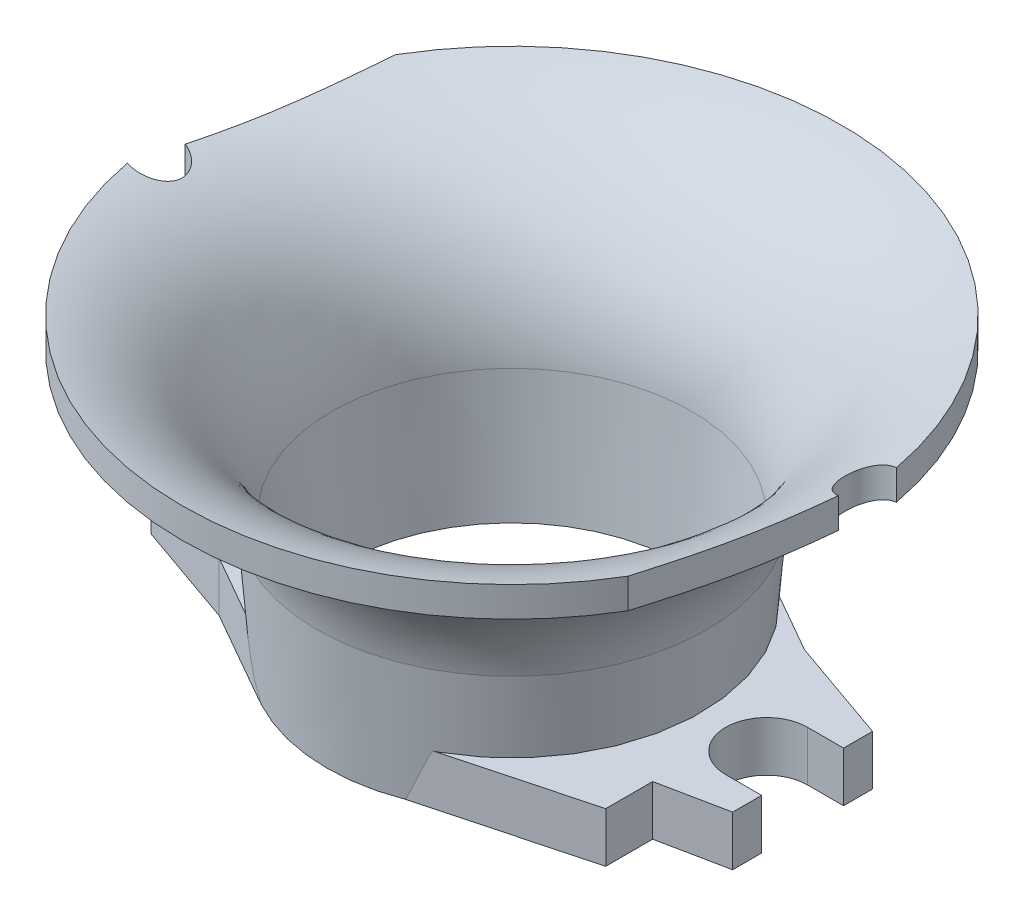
ISO-10303-21;
HEADER;
FILE_DESCRIPTION(('STEP AP214'),'2;1');
FILE_NAME('part.step','',(''),(''),'','','');
FILE_SCHEMA(('AUTOMOTIVE_DESIGN { 1 0 10303 214 1 1 1 1 }'));
ENDSEC;
DATA;
#1=APPLICATION_CONTEXT('core data for automotive mechanical design processes');
#2=APPLICATION_PROTOCOL_DEFINITION('international standard','automotive_design',2000,#1);
#3=PRODUCT_CONTEXT('',#1,'mechanical');
#4=PRODUCT('Part','Part','',(#3));
#5=PRODUCT_RELATED_PRODUCT_CATEGORY('part','',(#4));
#6=PRODUCT_DEFINITION_FORMATION('','',#4);
#7=PRODUCT_DEFINITION_CONTEXT('part definition',#1,'design');
#8=PRODUCT_DEFINITION('design','',#6,#7);
#9=PRODUCT_DEFINITION_SHAPE('','',#8);
#10=(LENGTH_UNIT() NAMED_UNIT(*) SI_UNIT(.MILLI.,.METRE.));
#11=(NAMED_UNIT(*) PLANE_ANGLE_UNIT() SI_UNIT($,.RADIAN.));
#12=(NAMED_UNIT(*) SI_UNIT($,.STERADIAN.) SOLID_ANGLE_UNIT());
#13=UNCERTAINTY_MEASURE_WITH_UNIT(LENGTH_MEASURE(1.E-05),#10,'distance_accuracy_value','');
#14=(GEOMETRIC_REPRESENTATION_CONTEXT(3) GLOBAL_UNCERTAINTY_ASSIGNED_CONTEXT((#13)) GLOBAL_UNIT_ASSIGNED_CONTEXT((#10,
#11,#12)) REPRESENTATION_CONTEXT('',''));
#15=CARTESIAN_POINT('',(0.,0.,0.));
#16=DIRECTION('',(0.,0.,1.));
#17=DIRECTION('',(1.,0.,0.));
#18=AXIS2_PLACEMENT_3D('',#15,#16,#17);
#19=CARTESIAN_POINT('',(0.,5.,0.));
#20=DIRECTION('',(0.,-1.,0.));
#21=DIRECTION('',(0.,0.,-1.));
#22=AXIS2_PLACEMENT_3D('',#19,#20,#21);
#23=CYLINDRICAL_SURFACE('',#22,18.5);
#24=CARTESIAN_POINT('',(0.,0.,0.));
#25=DIRECTION('',(0.,-1.,0.));
#26=DIRECTION('',(0.,0.,-1.));
#27=AXIS2_PLACEMENT_3D('',#24,#25,#26);
#28=CIRCLE('',#27,18.5);
#29=CARTESIAN_POINT('',(-9.17042851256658,0.,16.0671478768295));
#30=VERTEX_POINT('',#29);
#31=CARTESIAN_POINT('',(-6.61749453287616,0.,-17.2759591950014));
#32=VERTEX_POINT('',#31);
#33=EDGE_CURVE('E168',#30,#32,#28,.T.);
#34=ORIENTED_EDGE('',*,*,#33,.T.);
#35=DIRECTION('',(0.,-1.,0.));
#36=VECTOR('',#35,1.);
#37=CARTESIAN_POINT('',(-6.61749453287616,5.,-17.2759591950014));
#38=LINE('',#37,#36);
#39=CARTESIAN_POINT('',(-6.61749453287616,5.,-17.2759591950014));
#40=VERTEX_POINT('',#39);
#41=EDGE_CURVE('E13',#40,#32,#38,.T.);
#42=ORIENTED_EDGE('',*,*,#41,.F.);
#43=CARTESIAN_POINT('',(0.,5.,0.));
#44=DIRECTION('',(0.,-1.,0.));
#45=DIRECTION('',(0.,0.,-1.));
#46=AXIS2_PLACEMENT_3D('',#43,#44,#45);
#47=CIRCLE('',#46,18.5);
#48=CARTESIAN_POINT('',(-9.17042851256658,5.,16.0671478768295));
#49=VERTEX_POINT('',#48);
#50=EDGE_CURVE('E70',#49,#40,#47,.T.);
#51=ORIENTED_EDGE('',*,*,#50,.F.);
#52=DIRECTION('',(0.,-1.,0.));
#53=VECTOR('',#52,1.);
#54=CARTESIAN_POINT('',(-9.17042851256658,5.,16.0671478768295));
#55=LINE('',#54,#53);
#56=EDGE_CURVE('E55',#49,#30,#55,.T.);
#57=ORIENTED_EDGE('',*,*,#56,.T.);
#58=EDGE_LOOP('',(#34,#42,#51,#57));
#59=FACE_BOUND('',#58,.T.);
#60=ADVANCED_FACE('F52',(#59),#23,.F.);
#61=CARTESIAN_POINT('',(-4.74841119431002,5.,-17.7752586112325));
#62=DIRECTION('',(-0.258085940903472,0.,-0.966121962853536));
#63=DIRECTION('',(-0.966121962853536,0.,0.258085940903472));
#64=AXIS2_PLACEMENT_3D('',#61,#62,#63);
#65=PLANE('',#64);
#66=DIRECTION('',(0.966121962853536,0.,-0.258085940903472));
#67=VECTOR('',#66,1.);
#68=CARTESIAN_POINT('',(-4.74841119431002,0.,-17.7752586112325));
#69=LINE('',#68,#67);
#70=CARTESIAN_POINT('',(-22.4458388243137,0.,-13.047638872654));
#71=VERTEX_POINT('',#70);
#72=EDGE_CURVE('E189',#71,#32,#69,.T.);
#73=ORIENTED_EDGE('',*,*,#72,.F.);
#74=DIRECTION('',(0.,-1.,0.));
#75=VECTOR('',#74,1.);
#76=CARTESIAN_POINT('',(-22.4458388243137,5.,-13.047638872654));
#77=LINE('',#76,#75);
#78=CARTESIAN_POINT('',(-22.4458388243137,5.,-13.047638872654));
#79=VERTEX_POINT('',#78);
#80=EDGE_CURVE('E61',#79,#71,#77,.T.);
#81=ORIENTED_EDGE('',*,*,#80,.F.);
#82=DIRECTION('',(0.966121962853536,0.,-0.258085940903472));
#83=VECTOR('',#82,1.);
#84=CARTESIAN_POINT('',(-4.74841119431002,5.,-17.7752586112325));
#85=LINE('',#84,#83);
#86=EDGE_CURVE('E156',#79,#40,#85,.T.);
#87=ORIENTED_EDGE('',*,*,#86,.T.);
#88=ORIENTED_EDGE('',*,*,#41,.T.);
#89=EDGE_LOOP('',(#73,#81,#87,#88));
#90=FACE_BOUND('',#89,.T.);
#91=ADVANCED_FACE('F215',(#90),#65,.T.);
#92=CARTESIAN_POINT('',(-22.4458388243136,5.,1.49296831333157E-13));
#93=DIRECTION('',(-1.,0.,0.));
#94=DIRECTION('',(0.,0.,1.));
#95=AXIS2_PLACEMENT_3D('',#92,#93,#94);
#96=PLANE('',#95);
#97=DIRECTION('',(0.,0.,-1.));
#98=VECTOR('',#97,1.);
#99=CARTESIAN_POINT('',(-22.4458388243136,0.,1.49296831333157E-13));
#100=LINE('',#99,#98);
#101=CARTESIAN_POINT('',(-22.4458388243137,0.,-8.35315327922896));
#102=VERTEX_POINT('',#101);
#103=EDGE_CURVE('E144',#102,#71,#100,.T.);
#104=ORIENTED_EDGE('',*,*,#103,.F.);
#105=DIRECTION('',(0.,-1.,0.));
#106=VECTOR('',#105,1.);
#107=CARTESIAN_POINT('',(-22.4458388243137,5.,-8.35315327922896));
#108=LINE('',#107,#106);
#109=CARTESIAN_POINT('',(-22.4458388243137,5.,-8.35315327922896));
#110=VERTEX_POINT('',#109);
#111=EDGE_CURVE('E140',#110,#102,#108,.T.);
#112=ORIENTED_EDGE('',*,*,#111,.F.);
#113=DIRECTION('',(0.,0.,-1.));
#114=VECTOR('',#113,1.);
#115=CARTESIAN_POINT('',(-22.4458388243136,5.,1.49296831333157E-13));
#116=LINE('',#115,#114);
#117=EDGE_CURVE('E143',#110,#79,#116,.T.);
#118=ORIENTED_EDGE('',*,*,#117,.T.);
#119=ORIENTED_EDGE('',*,*,#80,.T.);
#120=EDGE_LOOP('',(#104,#112,#118,#119));
#121=FACE_BOUND('',#120,.T.);
#122=ADVANCED_FACE('F142',(#121),#96,.T.);
#123=CARTESIAN_POINT('',(-2.52253970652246,5.,-12.4046447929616));
#124=DIRECTION('',(-0.1992758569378,0.,-0.979943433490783));
#125=DIRECTION('',(-0.979943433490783,0.,0.1992758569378));
#126=AXIS2_PLACEMENT_3D('',#123,#124,#125);
#127=PLANE('',#126);
#128=DIRECTION('',(0.979943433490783,0.,-0.1992758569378));
#129=VECTOR('',#128,1.);
#130=CARTESIAN_POINT('',(-2.52253970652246,0.,-12.4046447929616));
#131=LINE('',#130,#129);
#132=CARTESIAN_POINT('',(-29.1,0.,-7.));
#133=VERTEX_POINT('',#132);
#134=EDGE_CURVE('E186',#133,#102,#131,.T.);
#135=ORIENTED_EDGE('',*,*,#134,.F.);
#136=DIRECTION('',(0.,-1.,0.));
#137=VECTOR('',#136,1.);
#138=CARTESIAN_POINT('',(-29.1,5.,-7.));
#139=LINE('',#138,#137);
#140=CARTESIAN_POINT('',(-29.1,5.,-7.));
#141=VERTEX_POINT('',#140);
#142=EDGE_CURVE('E149',#141,#133,#139,.T.);
#143=ORIENTED_EDGE('',*,*,#142,.F.);
#144=DIRECTION('',(0.979943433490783,0.,-0.1992758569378));
#145=VECTOR('',#144,1.);
#146=CARTESIAN_POINT('',(-2.52253970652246,5.,-12.4046447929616));
#147=LINE('',#146,#145);
#148=EDGE_CURVE('E154',#141,#110,#147,.T.);
#149=ORIENTED_EDGE('',*,*,#148,.T.);
#150=ORIENTED_EDGE('',*,*,#111,.T.);
#151=EDGE_LOOP('',(#135,#143,#149,#150));
#152=FACE_BOUND('',#151,.T.);
#153=ADVANCED_FACE('F158',(#152),#127,.T.);
#154=CARTESIAN_POINT('',(-29.1,5.,0.));
#155=DIRECTION('',(-1.,0.,0.));
#156=DIRECTION('',(0.,0.,1.));
#157=AXIS2_PLACEMENT_3D('',#154,#155,#156);
#158=PLANE('',#157);
#159=DIRECTION('',(0.,0.,-1.));
#160=VECTOR('',#159,1.);
#161=CARTESIAN_POINT('',(-29.1,0.,0.));
#162=LINE('',#161,#160);
#163=CARTESIAN_POINT('',(-29.1,0.,-4.1));
#164=VERTEX_POINT('',#163);
#165=EDGE_CURVE('E178',#164,#133,#162,.T.);
#166=ORIENTED_EDGE('',*,*,#165,.F.);
#167=DIRECTION('',(0.,-1.,0.));
#168=VECTOR('',#167,1.);
#169=CARTESIAN_POINT('',(-29.1,5.,-4.1));
#170=LINE('',#169,#168);
#171=CARTESIAN_POINT('',(-29.1,5.,-4.1));
#172=VERTEX_POINT('',#171);
#173=EDGE_CURVE('E194',#172,#164,#170,.T.);
#174=ORIENTED_EDGE('',*,*,#173,.F.);
#175=DIRECTION('',(0.,0.,-1.));
#176=VECTOR('',#175,1.);
#177=CARTESIAN_POINT('',(-29.1,5.,0.));
#178=LINE('',#177,#176);
#179=EDGE_CURVE('E159',#172,#141,#178,.T.);
#180=ORIENTED_EDGE('',*,*,#179,.T.);
#181=ORIENTED_EDGE('',*,*,#142,.T.);
#182=EDGE_LOOP('',(#166,#174,#180,#181));
#183=FACE_BOUND('',#182,.T.);
#184=ADVANCED_FACE('F228',(#183),#158,.T.);
#185=CARTESIAN_POINT('',(0.,5.,-4.1));
#186=DIRECTION('',(0.,0.,1.));
#187=DIRECTION('',(1.,0.,0.));
#188=AXIS2_PLACEMENT_3D('',#185,#186,#187);
#189=PLANE('',#188);
#190=DIRECTION('',(-1.,0.,0.));
#191=VECTOR('',#190,1.);
#192=CARTESIAN_POINT('',(0.,0.,-4.1));
#193=LINE('',#192,#191);
#194=CARTESIAN_POINT('',(-25.5,0.,-4.1));
#195=VERTEX_POINT('',#194);
#196=EDGE_CURVE('E183',#195,#164,#193,.T.);
#197=ORIENTED_EDGE('',*,*,#196,.F.);
#198=DIRECTION('',(0.,-1.,0.));
#199=VECTOR('',#198,1.);
#200=CARTESIAN_POINT('',(-25.5,5.,-4.1));
#201=LINE('',#200,#199);
#202=CARTESIAN_POINT('',(-25.5,5.,-4.1));
#203=VERTEX_POINT('',#202);
#204=EDGE_CURVE('E196',#203,#195,#201,.T.);
#205=ORIENTED_EDGE('',*,*,#204,.F.);
#206=DIRECTION('',(-1.,0.,0.));
#207=VECTOR('',#206,1.);
#208=CARTESIAN_POINT('',(0.,5.,-4.1));
#209=LINE('',#208,#207);
#210=EDGE_CURVE('E161',#203,#172,#209,.T.);
#211=ORIENTED_EDGE('',*,*,#210,.T.);
#212=ORIENTED_EDGE('',*,*,#173,.T.);
#213=EDGE_LOOP('',(#197,#205,#211,#212));
#214=FACE_BOUND('',#213,.T.);
#215=ADVANCED_FACE('F231',(#214),#189,.T.);
#216=CARTESIAN_POINT('',(-25.5,5.,0.));
#217=DIRECTION('',(0.,-1.,0.));
#218=DIRECTION('',(0.,0.,-1.));
#219=AXIS2_PLACEMENT_3D('',#216,#217,#218);
#220=CYLINDRICAL_SURFACE('',#219,4.1);
#221=CARTESIAN_POINT('',(-25.5,0.,0.));
#222=DIRECTION('',(0.,-1.,0.));
#223=DIRECTION('',(0.,0.,-1.));
#224=AXIS2_PLACEMENT_3D('',#221,#222,#223);
#225=CIRCLE('',#224,4.1);
#226=CARTESIAN_POINT('',(-25.5,0.,4.1));
#227=VERTEX_POINT('',#226);
#228=EDGE_CURVE('E181',#195,#227,#225,.T.);
#229=ORIENTED_EDGE('',*,*,#228,.T.);
#230=DIRECTION('',(0.,-1.,0.));
#231=VECTOR('',#230,1.);
#232=CARTESIAN_POINT('',(-25.5,5.,4.1));
#233=LINE('',#232,#231);
#234=CARTESIAN_POINT('',(-25.5,5.,4.1));
#235=VERTEX_POINT('',#234);
#236=EDGE_CURVE('E198',#235,#227,#233,.T.);
#237=ORIENTED_EDGE('',*,*,#236,.F.);
#238=CARTESIAN_POINT('',(-25.5,5.,0.));
#239=DIRECTION('',(0.,-1.,0.));
#240=DIRECTION('',(0.,0.,-1.));
#241=AXIS2_PLACEMENT_3D('',#238,#239,#240);
#242=CIRCLE('',#241,4.1);
#243=EDGE_CURVE('E348',#203,#235,#242,.T.);
#244=ORIENTED_EDGE('',*,*,#243,.F.);
#245=ORIENTED_EDGE('',*,*,#204,.T.);
#246=EDGE_LOOP('',(#229,#237,#244,#245));
#247=FACE_BOUND('',#246,.T.);
#248=ADVANCED_FACE('F236',(#247),#220,.F.);
#249=CARTESIAN_POINT('',(0.,5.,4.1));
#250=DIRECTION('',(0.,0.,1.));
#251=DIRECTION('',(1.,0.,0.));
#252=AXIS2_PLACEMENT_3D('',#249,#250,#251);
#253=PLANE('',#252);
#254=DIRECTION('',(-1.,0.,0.));
#255=VECTOR('',#254,1.);
#256=CARTESIAN_POINT('',(0.,0.,4.1));
#257=LINE('',#256,#255);
#258=CARTESIAN_POINT('',(-29.1,0.,4.1));
#259=VERTEX_POINT('',#258);
#260=EDGE_CURVE('E177',#227,#259,#257,.T.);
#261=ORIENTED_EDGE('',*,*,#260,.T.);
#262=DIRECTION('',(0.,-1.,0.));
#263=VECTOR('',#262,1.);
#264=CARTESIAN_POINT('',(-29.1,5.,4.1));
#265=LINE('',#264,#263);
#266=CARTESIAN_POINT('',(-29.1,5.,4.1));
#267=VERTEX_POINT('',#266);
#268=EDGE_CURVE('E201',#267,#259,#265,.T.);
#269=ORIENTED_EDGE('',*,*,#268,.F.);
#270=DIRECTION('',(-1.,0.,0.));
#271=VECTOR('',#270,1.);
#272=CARTESIAN_POINT('',(0.,5.,4.1));
#273=LINE('',#272,#271);
#274=EDGE_CURVE('E347',#235,#267,#273,.T.);
#275=ORIENTED_EDGE('',*,*,#274,.F.);
#276=ORIENTED_EDGE('',*,*,#236,.T.);
#277=EDGE_LOOP('',(#261,#269,#275,#276));
#278=FACE_BOUND('',#277,.T.);
#279=ADVANCED_FACE('F240',(#278),#253,.F.);
#280=CARTESIAN_POINT('',(-29.1,0.,7.));
#281=VERTEX_POINT('',#280);
#282=EDGE_CURVE('E174',#281,#259,#162,.T.);
#283=ORIENTED_EDGE('',*,*,#282,.F.);
#284=DIRECTION('',(0.,-1.,0.));
#285=VECTOR('',#284,1.);
#286=CARTESIAN_POINT('',(-29.1,5.,7.));
#287=LINE('',#286,#285);
#288=CARTESIAN_POINT('',(-29.1,5.,7.));
#289=VERTEX_POINT('',#288);
#290=EDGE_CURVE('E203',#289,#281,#287,.T.);
#291=ORIENTED_EDGE('',*,*,#290,.F.);
#292=EDGE_CURVE('E163',#289,#267,#178,.T.);
#293=ORIENTED_EDGE('',*,*,#292,.T.);
#294=ORIENTED_EDGE('',*,*,#268,.T.);
#295=EDGE_LOOP('',(#283,#291,#293,#294));
#296=FACE_BOUND('',#295,.T.);
#297=ADVANCED_FACE('F233',(#296),#158,.T.);
#298=CARTESIAN_POINT('',(-5.36480778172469,5.,15.314598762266));
#299=DIRECTION('',(0.330608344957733,0.,-0.943768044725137));
#300=DIRECTION('',(-0.943768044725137,0.,-0.330608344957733));
#301=AXIS2_PLACEMENT_3D('',#298,#299,#300);
#302=PLANE('',#301);
#303=DIRECTION('',(0.943768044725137,0.,0.330608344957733));
#304=VECTOR('',#303,1.);
#305=CARTESIAN_POINT('',(-5.36480778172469,0.,15.314598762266));
#306=LINE('',#305,#304);
#307=CARTESIAN_POINT('',(-18.6314711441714,0.,10.6671966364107));
#308=VERTEX_POINT('',#307);
#309=EDGE_CURVE('E172',#281,#308,#306,.T.);
#310=ORIENTED_EDGE('',*,*,#309,.T.);
#311=DIRECTION('',(0.,-1.,0.));
#312=VECTOR('',#311,1.);
#313=CARTESIAN_POINT('',(-18.6314711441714,5.,10.6671966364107));
#314=LINE('',#313,#312);
#315=CARTESIAN_POINT('',(-18.6314711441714,5.,10.6671966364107));
#316=VERTEX_POINT('',#315);
#317=EDGE_CURVE('E204',#316,#308,#314,.T.);
#318=ORIENTED_EDGE('',*,*,#317,.F.);
#319=DIRECTION('',(0.943768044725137,0.,0.330608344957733));
#320=VECTOR('',#319,1.);
#321=CARTESIAN_POINT('',(-5.36480778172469,5.,15.314598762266));
#322=LINE('',#321,#320);
#323=EDGE_CURVE('E343',#289,#316,#322,.T.);
#324=ORIENTED_EDGE('',*,*,#323,.F.);
#325=ORIENTED_EDGE('',*,*,#290,.T.);
#326=EDGE_LOOP('',(#310,#318,#324,#325));
#327=FACE_BOUND('',#326,.T.);
#328=ADVANCED_FACE('F245',(#327),#302,.F.);
#329=CARTESIAN_POINT('',(-9.17042851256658,5.,16.0671478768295));
#330=DIRECTION('',(0.495698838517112,0.,-0.86849447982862));
#331=DIRECTION('',(-0.86849447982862,0.,-0.495698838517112));
#332=AXIS2_PLACEMENT_3D('',#329,#330,#331);
#333=PLANE('',#332);
#334=DIRECTION('',(0.86849447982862,0.,0.495698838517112));
#335=VECTOR('',#334,1.);
#336=CARTESIAN_POINT('',(-9.17042851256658,0.,16.0671478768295));
#337=LINE('',#336,#335);
#338=EDGE_CURVE('E170',#308,#30,#337,.T.);
#339=ORIENTED_EDGE('',*,*,#338,.T.);
#340=ORIENTED_EDGE('',*,*,#56,.F.);
#341=DIRECTION('',(0.86849447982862,0.,0.495698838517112));
#342=VECTOR('',#341,1.);
#343=CARTESIAN_POINT('',(-9.17042851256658,5.,16.0671478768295));
#344=LINE('',#343,#342);
#345=EDGE_CURVE('E118',#316,#49,#344,.T.);
#346=ORIENTED_EDGE('',*,*,#345,.F.);
#347=ORIENTED_EDGE('',*,*,#317,.T.);
#348=EDGE_LOOP('',(#339,#340,#346,#347));
#349=FACE_BOUND('',#348,.T.);
#350=ADVANCED_FACE('F247',(#349),#333,.F.);
#351=CARTESIAN_POINT('',(0.,5.,0.));
#352=DIRECTION('',(0.,-1.,0.));
#353=DIRECTION('',(0.,0.,-1.));
#354=AXIS2_PLACEMENT_3D('',#351,#352,#353);
#355=PLANE('',#354);
#356=ORIENTED_EDGE('',*,*,#50,.T.);
#357=ORIENTED_EDGE('',*,*,#86,.F.);
#358=ORIENTED_EDGE('',*,*,#117,.F.);
#359=ORIENTED_EDGE('',*,*,#148,.F.);
#360=ORIENTED_EDGE('',*,*,#179,.F.);
#361=ORIENTED_EDGE('',*,*,#210,.F.);
#362=ORIENTED_EDGE('',*,*,#243,.T.);
#363=ORIENTED_EDGE('',*,*,#274,.T.);
#364=ORIENTED_EDGE('',*,*,#292,.F.);
#365=ORIENTED_EDGE('',*,*,#323,.T.);
#366=ORIENTED_EDGE('',*,*,#345,.T.);
#367=EDGE_LOOP('',(#356,#357,#358,#359,#360,#361,#362,#363,#364,#365,#366));
#368=FACE_BOUND('',#367,.T.);
#369=ADVANCED_FACE('F152',(#368),#355,.F.);
#370=CARTESIAN_POINT('',(0.,0.,0.));
#371=DIRECTION('',(0.,-1.,0.));
#372=DIRECTION('',(0.,0.,-1.));
#373=AXIS2_PLACEMENT_3D('',#370,#371,#372);
#374=PLANE('',#373);
#375=ORIENTED_EDGE('',*,*,#33,.F.);
#376=ORIENTED_EDGE('',*,*,#338,.F.);
#377=ORIENTED_EDGE('',*,*,#309,.F.);
#378=ORIENTED_EDGE('',*,*,#282,.T.);
#379=ORIENTED_EDGE('',*,*,#260,.F.);
#380=ORIENTED_EDGE('',*,*,#228,.F.);
#381=ORIENTED_EDGE('',*,*,#196,.T.);
#382=ORIENTED_EDGE('',*,*,#165,.T.);
#383=ORIENTED_EDGE('',*,*,#134,.T.);
#384=ORIENTED_EDGE('',*,*,#103,.T.);
#385=ORIENTED_EDGE('',*,*,#72,.T.);
#386=EDGE_LOOP('',(#375,#376,#377,#378,#379,#380,#381,#382,#383,#384,#385));
#387=FACE_BOUND('',#386,.T.);
#388=ADVANCED_FACE('F213',(#387),#374,.T.);
#389=CLOSED_SHELL('',(#60,#91,#122,#153,#184,#215,#248,#279,#297,#328,#350,#369,#388));
#390=MANIFOLD_SOLID_BREP('B2',#389);
#391=CARTESIAN_POINT('',(9.17042851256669,5.,-16.0671478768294));
#392=DIRECTION('',(-0.495698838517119,0.,0.868494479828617));
#393=DIRECTION('',(0.868494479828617,0.,0.495698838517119));
#394=AXIS2_PLACEMENT_3D('',#391,#392,#393);
#395=PLANE('',#394);
#396=DIRECTION('',(-0.868494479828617,0.,-0.495698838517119));
#397=VECTOR('',#396,1.);
#398=CARTESIAN_POINT('',(9.17042851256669,0.,-16.0671478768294));
#399=LINE('',#398,#397);
#400=CARTESIAN_POINT('',(18.6314711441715,0.,-10.6671966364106));
#401=VERTEX_POINT('',#400);
#402=CARTESIAN_POINT('',(9.1704285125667,0.,-16.0671478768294));
#403=VERTEX_POINT('',#402);
#404=EDGE_CURVE('E492',#401,#403,#399,.T.);
#405=ORIENTED_EDGE('',*,*,#404,.T.);
#406=DIRECTION('',(0.,-1.,0.));
#407=VECTOR('',#406,1.);
#408=CARTESIAN_POINT('',(9.1704285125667,5.,-16.0671478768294));
#409=LINE('',#408,#407);
#410=CARTESIAN_POINT('',(9.1704285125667,5.,-16.0671478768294));
#411=VERTEX_POINT('',#410);
#412=EDGE_CURVE('E50',#411,#403,#409,.T.);
#413=ORIENTED_EDGE('',*,*,#412,.F.);
#414=DIRECTION('',(-0.868494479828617,0.,-0.495698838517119));
#415=VECTOR('',#414,1.);
#416=CARTESIAN_POINT('',(9.17042851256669,5.,-16.0671478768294));
#417=LINE('',#416,#415);
#418=CARTESIAN_POINT('',(18.6314711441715,5.,-10.6671966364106));
#419=VERTEX_POINT('',#418);
#420=EDGE_CURVE('E513',#419,#411,#417,.T.);
#421=ORIENTED_EDGE('',*,*,#420,.F.);
#422=DIRECTION('',(0.,-1.,0.));
#423=VECTOR('',#422,1.);
#424=CARTESIAN_POINT('',(18.6314711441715,5.,-10.6671966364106));
#425=LINE('',#424,#423);
#426=EDGE_CURVE('E381',#419,#401,#425,.T.);
#427=ORIENTED_EDGE('',*,*,#426,.T.);
#428=EDGE_LOOP('',(#405,#413,#421,#427));
#429=FACE_BOUND('',#428,.T.);
#430=ADVANCED_FACE('F378',(#429),#395,.F.);
#431=CARTESIAN_POINT('',(0.,5.,0.));
#432=DIRECTION('',(0.,-1.,0.));
#433=DIRECTION('',(0.,0.,-1.));
#434=AXIS2_PLACEMENT_3D('',#431,#432,#433);
#435=CYLINDRICAL_SURFACE('',#434,18.5);
#436=CARTESIAN_POINT('',(0.,0.,0.));
#437=DIRECTION('',(0.,-1.,0.));
#438=DIRECTION('',(0.,0.,-1.));
#439=AXIS2_PLACEMENT_3D('',#436,#437,#438);
#440=CIRCLE('',#439,18.5);
#441=CARTESIAN_POINT('',(6.6174945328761,0.,17.2759591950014));
#442=VERTEX_POINT('',#441);
#443=EDGE_CURVE('E438',#403,#442,#440,.T.);
#444=ORIENTED_EDGE('',*,*,#443,.T.);
#445=DIRECTION('',(0.,-1.,0.));
#446=VECTOR('',#445,1.);
#447=CARTESIAN_POINT('',(6.6174945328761,5.,17.2759591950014));
#448=LINE('',#447,#446);
#449=CARTESIAN_POINT('',(6.6174945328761,5.,17.2759591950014));
#450=VERTEX_POINT('',#449);
#451=EDGE_CURVE('E387',#450,#442,#448,.T.);
#452=ORIENTED_EDGE('',*,*,#451,.F.);
#453=CARTESIAN_POINT('',(0.,5.,0.));
#454=DIRECTION('',(0.,-1.,0.));
#455=DIRECTION('',(0.,0.,-1.));
#456=AXIS2_PLACEMENT_3D('',#453,#454,#455);
#457=CIRCLE('',#456,18.5);
#458=EDGE_CURVE('E395',#411,#450,#457,.T.);
#459=ORIENTED_EDGE('',*,*,#458,.F.);
#460=ORIENTED_EDGE('',*,*,#412,.T.);
#461=EDGE_LOOP('',(#444,#452,#459,#460));
#462=FACE_BOUND('',#461,.T.);
#463=ADVANCED_FACE('F554',(#462),#435,.F.);
#464=CARTESIAN_POINT('',(4.7484111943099,5.,17.7752586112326));
#465=DIRECTION('',(0.258085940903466,0.,0.966121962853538));
#466=DIRECTION('',(0.966121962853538,0.,-0.258085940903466));
#467=AXIS2_PLACEMENT_3D('',#464,#465,#466);
#468=PLANE('',#467);
#469=DIRECTION('',(-0.966121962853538,0.,0.258085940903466));
#470=VECTOR('',#469,1.);
#471=CARTESIAN_POINT('',(4.7484111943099,0.,17.7752586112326));
#472=LINE('',#471,#470);
#473=CARTESIAN_POINT('',(22.4458388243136,0.,13.0476388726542));
#474=VERTEX_POINT('',#473);
#475=EDGE_CURVE('E471',#474,#442,#472,.T.);
#476=ORIENTED_EDGE('',*,*,#475,.F.);
#477=DIRECTION('',(0.,-1.,0.));
#478=VECTOR('',#477,1.);
#479=CARTESIAN_POINT('',(22.4458388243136,5.,13.0476388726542));
#480=LINE('',#479,#478);
#481=CARTESIAN_POINT('',(22.4458388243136,5.,13.0476388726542));
#482=VERTEX_POINT('',#481);
#483=EDGE_CURVE('E467',#482,#474,#480,.T.);
#484=ORIENTED_EDGE('',*,*,#483,.F.);
#485=DIRECTION('',(-0.966121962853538,0.,0.258085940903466));
#486=VECTOR('',#485,1.);
#487=CARTESIAN_POINT('',(4.7484111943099,5.,17.7752586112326));
#488=LINE('',#487,#486);
#489=EDGE_CURVE('E470',#482,#450,#488,.T.);
#490=ORIENTED_EDGE('',*,*,#489,.T.);
#491=ORIENTED_EDGE('',*,*,#451,.T.);
#492=EDGE_LOOP('',(#476,#484,#490,#491));
#493=FACE_BOUND('',#492,.T.);
#494=ADVANCED_FACE('F469',(#493),#468,.T.);
#495=CARTESIAN_POINT('',(22.4458388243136,5.,0.));
#496=DIRECTION('',(1.,0.,0.));
#497=DIRECTION('',(0.,0.,-1.));
#498=AXIS2_PLACEMENT_3D('',#495,#496,#497);
#499=PLANE('',#498);
#500=DIRECTION('',(0.,0.,1.));
#501=VECTOR('',#500,1.);
#502=CARTESIAN_POINT('',(22.4458388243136,0.,0.));
#503=LINE('',#502,#501);
#504=CARTESIAN_POINT('',(22.4458388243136,0.,8.35315327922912));
#505=VERTEX_POINT('',#504);
#506=EDGE_CURVE('E510',#505,#474,#503,.T.);
#507=ORIENTED_EDGE('',*,*,#506,.F.);
#508=DIRECTION('',(0.,-1.,0.));
#509=VECTOR('',#508,1.);
#510=CARTESIAN_POINT('',(22.4458388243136,5.,8.35315327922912));
#511=LINE('',#510,#509);
#512=CARTESIAN_POINT('',(22.4458388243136,5.,8.35315327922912));
#513=VERTEX_POINT('',#512);
#514=EDGE_CURVE('E476',#513,#505,#511,.T.);
#515=ORIENTED_EDGE('',*,*,#514,.F.);
#516=DIRECTION('',(0.,0.,1.));
#517=VECTOR('',#516,1.);
#518=CARTESIAN_POINT('',(22.4458388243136,5.,0.));
#519=LINE('',#518,#517);
#520=EDGE_CURVE('E481',#513,#482,#519,.T.);
#521=ORIENTED_EDGE('',*,*,#520,.T.);
#522=ORIENTED_EDGE('',*,*,#483,.T.);
#523=EDGE_LOOP('',(#507,#515,#521,#522));
#524=FACE_BOUND('',#523,.T.);
#525=ADVANCED_FACE('F484',(#524),#499,.T.);
#526=CARTESIAN_POINT('',(2.52253970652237,5.,12.4046447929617));
#527=DIRECTION('',(0.199275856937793,0.,0.979943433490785));
#528=DIRECTION('',(0.979943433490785,0.,-0.199275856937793));
#529=AXIS2_PLACEMENT_3D('',#526,#527,#528);
#530=PLANE('',#529);
#531=DIRECTION('',(-0.979943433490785,0.,0.199275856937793));
#532=VECTOR('',#531,1.);
#533=CARTESIAN_POINT('',(2.52253970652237,0.,12.4046447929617));
#534=LINE('',#533,#532);
#535=CARTESIAN_POINT('',(29.1,0.,7.));
#536=VERTEX_POINT('',#535);
#537=EDGE_CURVE('E507',#536,#505,#534,.T.);
#538=ORIENTED_EDGE('',*,*,#537,.F.);
#539=DIRECTION('',(0.,-1.,0.));
#540=VECTOR('',#539,1.);
#541=CARTESIAN_POINT('',(29.1,5.,7.));
#542=LINE('',#541,#540);
#543=CARTESIAN_POINT('',(29.1,5.,7.));
#544=VERTEX_POINT('',#543);
#545=EDGE_CURVE('E517',#544,#536,#542,.T.);
#546=ORIENTED_EDGE('',*,*,#545,.F.);
#547=DIRECTION('',(-0.979943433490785,0.,0.199275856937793));
#548=VECTOR('',#547,1.);
#549=CARTESIAN_POINT('',(2.52253970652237,5.,12.4046447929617));
#550=LINE('',#549,#548);
#551=EDGE_CURVE('E485',#544,#513,#550,.T.);
#552=ORIENTED_EDGE('',*,*,#551,.T.);
#553=ORIENTED_EDGE('',*,*,#514,.T.);
#554=EDGE_LOOP('',(#538,#546,#552,#553));
#555=FACE_BOUND('',#554,.T.);
#556=ADVANCED_FACE('F567',(#555),#530,.T.);
#557=CARTESIAN_POINT('',(29.1,5.,0.));
#558=DIRECTION('',(-1.,0.,0.));
#559=DIRECTION('',(0.,0.,1.));
#560=AXIS2_PLACEMENT_3D('',#557,#558,#559);
#561=PLANE('',#560);
#562=DIRECTION('',(0.,0.,-1.));
#563=VECTOR('',#562,1.);
#564=CARTESIAN_POINT('',(29.1,0.,0.));
#565=LINE('',#564,#563);
#566=CARTESIAN_POINT('',(29.1,0.,4.1));
#567=VERTEX_POINT('',#566);
#568=EDGE_CURVE('E500',#536,#567,#565,.T.);
#569=ORIENTED_EDGE('',*,*,#568,.T.);
#570=DIRECTION('',(0.,-1.,0.));
#571=VECTOR('',#570,1.);
#572=CARTESIAN_POINT('',(29.1,5.,4.1));
#573=LINE('',#572,#571);
#574=CARTESIAN_POINT('',(29.1,5.,4.1));
#575=VERTEX_POINT('',#574);
#576=EDGE_CURVE('E519',#575,#567,#573,.T.);
#577=ORIENTED_EDGE('',*,*,#576,.F.);
#578=DIRECTION('',(0.,0.,-1.));
#579=VECTOR('',#578,1.);
#580=CARTESIAN_POINT('',(29.1,5.,0.));
#581=LINE('',#580,#579);
#582=EDGE_CURVE('E487',#544,#575,#581,.T.);
#583=ORIENTED_EDGE('',*,*,#582,.F.);
#584=ORIENTED_EDGE('',*,*,#545,.T.);
#585=EDGE_LOOP('',(#569,#577,#583,#584));
#586=FACE_BOUND('',#585,.T.);
#587=ADVANCED_FACE('F551',(#586),#561,.F.);
#588=CARTESIAN_POINT('',(0.,5.,4.1));
#589=DIRECTION('',(0.,0.,-1.));
#590=DIRECTION('',(-1.,0.,0.));
#591=AXIS2_PLACEMENT_3D('',#588,#589,#590);
#592=PLANE('',#591);
#593=DIRECTION('',(1.,0.,0.));
#594=VECTOR('',#593,1.);
#595=CARTESIAN_POINT('',(0.,0.,4.1));
#596=LINE('',#595,#594);
#597=CARTESIAN_POINT('',(25.5,0.,4.1));
#598=VERTEX_POINT('',#597);
#599=EDGE_CURVE('E504',#598,#567,#596,.T.);
#600=ORIENTED_EDGE('',*,*,#599,.F.);
#601=DIRECTION('',(0.,-1.,0.));
#602=VECTOR('',#601,1.);
#603=CARTESIAN_POINT('',(25.5,5.,4.1));
#604=LINE('',#603,#602);
#605=CARTESIAN_POINT('',(25.5,5.,4.1));
#606=VERTEX_POINT('',#605);
#607=EDGE_CURVE('E521',#606,#598,#604,.T.);
#608=ORIENTED_EDGE('',*,*,#607,.F.);
#609=DIRECTION('',(1.,0.,0.));
#610=VECTOR('',#609,1.);
#611=CARTESIAN_POINT('',(0.,5.,4.1));
#612=LINE('',#611,#610);
#613=EDGE_CURVE('E595',#606,#575,#612,.T.);
#614=ORIENTED_EDGE('',*,*,#613,.T.);
#615=ORIENTED_EDGE('',*,*,#576,.T.);
#616=EDGE_LOOP('',(#600,#608,#614,#615));
#617=FACE_BOUND('',#616,.T.);
#618=ADVANCED_FACE('F572',(#617),#592,.T.);
#619=CARTESIAN_POINT('',(25.5,5.,0.));
#620=DIRECTION('',(0.,-1.,0.));
#621=DIRECTION('',(0.,0.,-1.));
#622=AXIS2_PLACEMENT_3D('',#619,#620,#621);
#623=CYLINDRICAL_SURFACE('',#622,4.1);
#624=CARTESIAN_POINT('',(25.5,0.,0.));
#625=DIRECTION('',(0.,-1.,0.));
#626=DIRECTION('',(0.,0.,-1.));
#627=AXIS2_PLACEMENT_3D('',#624,#625,#626);
#628=CIRCLE('',#627,4.1);
#629=CARTESIAN_POINT('',(25.5,0.,-4.1));
#630=VERTEX_POINT('',#629);
#631=EDGE_CURVE('E502',#598,#630,#628,.T.);
#632=ORIENTED_EDGE('',*,*,#631,.T.);
#633=DIRECTION('',(0.,-1.,0.));
#634=VECTOR('',#633,1.);
#635=CARTESIAN_POINT('',(25.5,5.,-4.1));
#636=LINE('',#635,#634);
#637=CARTESIAN_POINT('',(25.5,5.,-4.1));
#638=VERTEX_POINT('',#637);
#639=EDGE_CURVE('E523',#638,#630,#636,.T.);
#640=ORIENTED_EDGE('',*,*,#639,.F.);
#641=CARTESIAN_POINT('',(25.5,5.,0.));
#642=DIRECTION('',(0.,-1.,0.));
#643=DIRECTION('',(0.,0.,-1.));
#644=AXIS2_PLACEMENT_3D('',#641,#642,#643);
#645=CIRCLE('',#644,4.1);
#646=EDGE_CURVE('E592',#606,#638,#645,.T.);
#647=ORIENTED_EDGE('',*,*,#646,.F.);
#648=ORIENTED_EDGE('',*,*,#607,.T.);
#649=EDGE_LOOP('',(#632,#640,#647,#648));
#650=FACE_BOUND('',#649,.T.);
#651=ADVANCED_FACE('F576',(#650),#623,.F.);
#652=CARTESIAN_POINT('',(0.,5.,-4.1));
#653=DIRECTION('',(0.,0.,-1.));
#654=DIRECTION('',(-1.,0.,0.));
#655=AXIS2_PLACEMENT_3D('',#652,#653,#654);
#656=PLANE('',#655);
#657=DIRECTION('',(1.,0.,0.));
#658=VECTOR('',#657,1.);
#659=CARTESIAN_POINT('',(0.,0.,-4.1));
#660=LINE('',#659,#658);
#661=CARTESIAN_POINT('',(29.1,0.,-4.1));
#662=VERTEX_POINT('',#661);
#663=EDGE_CURVE('E499',#630,#662,#660,.T.);
#664=ORIENTED_EDGE('',*,*,#663,.T.);
#665=DIRECTION('',(0.,-1.,0.));
#666=VECTOR('',#665,1.);
#667=CARTESIAN_POINT('',(29.1,5.,-4.1));
#668=LINE('',#667,#666);
#669=CARTESIAN_POINT('',(29.1,5.,-4.1));
#670=VERTEX_POINT('',#669);
#671=EDGE_CURVE('E526',#670,#662,#668,.T.);
#672=ORIENTED_EDGE('',*,*,#671,.F.);
#673=DIRECTION('',(1.,0.,0.));
#674=VECTOR('',#673,1.);
#675=CARTESIAN_POINT('',(0.,5.,-4.1));
#676=LINE('',#675,#674);
#677=EDGE_CURVE('E590',#638,#670,#676,.T.);
#678=ORIENTED_EDGE('',*,*,#677,.F.);
#679=ORIENTED_EDGE('',*,*,#639,.T.);
#680=EDGE_LOOP('',(#664,#672,#678,#679));
#681=FACE_BOUND('',#680,.T.);
#682=ADVANCED_FACE('F548',(#681),#656,.F.);
#683=CARTESIAN_POINT('',(29.1,0.,-7.));
#684=VERTEX_POINT('',#683);
#685=EDGE_CURVE('E497',#662,#684,#565,.T.);
#686=ORIENTED_EDGE('',*,*,#685,.T.);
#687=DIRECTION('',(0.,-1.,0.));
#688=VECTOR('',#687,1.);
#689=CARTESIAN_POINT('',(29.1,5.,-7.));
#690=LINE('',#689,#688);
#691=CARTESIAN_POINT('',(29.1,5.,-7.));
#692=VERTEX_POINT('',#691);
#693=EDGE_CURVE('E528',#692,#684,#690,.T.);
#694=ORIENTED_EDGE('',*,*,#693,.F.);
#695=EDGE_CURVE('E589',#670,#692,#581,.T.);
#696=ORIENTED_EDGE('',*,*,#695,.F.);
#697=ORIENTED_EDGE('',*,*,#671,.T.);
#698=EDGE_LOOP('',(#686,#694,#696,#697));
#699=FACE_BOUND('',#698,.T.);
#700=ADVANCED_FACE('F542',(#699),#561,.F.);
#701=CARTESIAN_POINT('',(5.36480778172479,5.,-15.314598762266));
#702=DIRECTION('',(-0.330608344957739,0.,0.943768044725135));
#703=DIRECTION('',(0.943768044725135,0.,0.330608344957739));
#704=AXIS2_PLACEMENT_3D('',#701,#702,#703);
#705=PLANE('',#704);
#706=DIRECTION('',(-0.943768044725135,0.,-0.330608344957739));
#707=VECTOR('',#706,1.);
#708=CARTESIAN_POINT('',(5.36480778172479,0.,-15.314598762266));
#709=LINE('',#708,#707);
#710=EDGE_CURVE('E495',#684,#401,#709,.T.);
#711=ORIENTED_EDGE('',*,*,#710,.T.);
#712=ORIENTED_EDGE('',*,*,#426,.F.);
#713=DIRECTION('',(-0.943768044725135,0.,-0.330608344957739));
#714=VECTOR('',#713,1.);
#715=CARTESIAN_POINT('',(5.36480778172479,5.,-15.314598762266));
#716=LINE('',#715,#714);
#717=EDGE_CURVE('E445',#692,#419,#716,.T.);
#718=ORIENTED_EDGE('',*,*,#717,.F.);
#719=ORIENTED_EDGE('',*,*,#693,.T.);
#720=EDGE_LOOP('',(#711,#712,#718,#719));
#721=FACE_BOUND('',#720,.T.);
#722=ADVANCED_FACE('F540',(#721),#705,.F.);
#723=CARTESIAN_POINT('',(0.,5.,0.));
#724=DIRECTION('',(0.,-1.,0.));
#725=DIRECTION('',(0.,0.,-1.));
#726=AXIS2_PLACEMENT_3D('',#723,#724,#725);
#727=PLANE('',#726);
#728=ORIENTED_EDGE('',*,*,#420,.T.);
#729=ORIENTED_EDGE('',*,*,#458,.T.);
#730=ORIENTED_EDGE('',*,*,#489,.F.);
#731=ORIENTED_EDGE('',*,*,#520,.F.);
#732=ORIENTED_EDGE('',*,*,#551,.F.);
#733=ORIENTED_EDGE('',*,*,#582,.T.);
#734=ORIENTED_EDGE('',*,*,#613,.F.);
#735=ORIENTED_EDGE('',*,*,#646,.T.);
#736=ORIENTED_EDGE('',*,*,#677,.T.);
#737=ORIENTED_EDGE('',*,*,#695,.T.);
#738=ORIENTED_EDGE('',*,*,#717,.T.);
#739=EDGE_LOOP('',(#728,#729,#730,#731,#732,#733,#734,#735,#736,#737,#738));
#740=FACE_BOUND('',#739,.T.);
#741=ADVANCED_FACE('F479',(#740),#727,.F.);
#742=CARTESIAN_POINT('',(0.,0.,0.));
#743=DIRECTION('',(0.,-1.,0.));
#744=DIRECTION('',(0.,0.,-1.));
#745=AXIS2_PLACEMENT_3D('',#742,#743,#744);
#746=PLANE('',#745);
#747=ORIENTED_EDGE('',*,*,#404,.F.);
#748=ORIENTED_EDGE('',*,*,#710,.F.);
#749=ORIENTED_EDGE('',*,*,#685,.F.);
#750=ORIENTED_EDGE('',*,*,#663,.F.);
#751=ORIENTED_EDGE('',*,*,#631,.F.);
#752=ORIENTED_EDGE('',*,*,#599,.T.);
#753=ORIENTED_EDGE('',*,*,#568,.F.);
#754=ORIENTED_EDGE('',*,*,#537,.T.);
#755=ORIENTED_EDGE('',*,*,#506,.T.);
#756=ORIENTED_EDGE('',*,*,#475,.T.);
#757=ORIENTED_EDGE('',*,*,#443,.F.);
#758=EDGE_LOOP('',(#747,#748,#749,#750,#751,#752,#753,#754,#755,#756,#757));
#759=FACE_BOUND('',#758,.T.);
#760=ADVANCED_FACE('F537',(#759),#746,.T.);
#761=CLOSED_SHELL('',(#430,#463,#494,#525,#556,#587,#618,#651,#682,#700,#722,#741,#760));
#762=MANIFOLD_SOLID_BREP('B7',#761);
#763=CARTESIAN_POINT('',(0.,10.9253119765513,0.));
#764=DIRECTION('',(0.,1.,0.));
#765=DIRECTION('',(0.,0.,1.));
#766=AXIS2_PLACEMENT_3D('',#763,#764,#765);
#767=TOROIDAL_SURFACE('',#766,37.5379214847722,19.6070511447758);
#768=CARTESIAN_POINT('',(0.,12.6863479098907,0.));
#769=DIRECTION('',(0.,1.,0.));
#770=DIRECTION('',(0.,0.,1.));
#771=AXIS2_PLACEMENT_3D('',#768,#769,#770);
#772=CIRCLE('',#771,18.0101154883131);
#773=CARTESIAN_POINT('',(0.,12.6863479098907,18.0101154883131));
#774=VERTEX_POINT('',#773);
#775=EDGE_CURVE('E833',#774,#774,#772,.T.);
#776=ORIENTED_EDGE('',*,*,#775,.F.);
#777=EDGE_LOOP('',(#776));
#778=FACE_BOUND('',#777,.T.);
#779=CARTESIAN_POINT('',(32.4425230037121,30.0002,-6.0446829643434));
#780=CARTESIAN_POINT('',(32.3587449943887,29.9598967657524,-5.5695542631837));
#781=CARTESIAN_POINT('',(32.2749685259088,29.9194411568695,-5.09443430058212));
#782=CARTESIAN_POINT('',(32.1073930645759,29.8398125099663,-4.14406663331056));
#783=CARTESIAN_POINT('',(32.0235940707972,29.800639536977,-3.66881892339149));
#784=CARTESIAN_POINT('',(31.8559010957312,29.7251429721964,-2.71778480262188));
#785=CARTESIAN_POINT('',(31.7720070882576,29.6888212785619,-2.24199824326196));
#786=CARTESIAN_POINT('',(31.6041664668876,29.6205163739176,-1.29012677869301));
#787=CARTESIAN_POINT('',(31.5202198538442,29.5885330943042,-0.814041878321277));
#788=CARTESIAN_POINT('',(31.3525191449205,29.5302946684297,0.13703610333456));
#789=CARTESIAN_POINT('',(31.268765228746,29.5040225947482,0.612028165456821));
#790=CARTESIAN_POINT('',(31.1012012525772,29.4581620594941,1.56233069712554));
#791=CARTESIAN_POINT('',(31.0173911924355,29.438573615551,2.03764116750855));
#792=CARTESIAN_POINT('',(30.8497558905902,29.4069002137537,2.98834820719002));
#793=CARTESIAN_POINT('',(30.7659306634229,29.3948127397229,3.46374469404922));
#794=CARTESIAN_POINT('',(30.598256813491,29.3786385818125,4.41467035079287));
#795=CARTESIAN_POINT('',(30.5144081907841,29.374551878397,4.89019952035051));
#796=CARTESIAN_POINT('',(30.3467109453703,29.374551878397,5.84125785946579));
#797=CARTESIAN_POINT('',(30.2628623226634,29.3786385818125,6.31678702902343));
#798=CARTESIAN_POINT('',(30.0951884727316,29.3948127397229,7.26771268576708));
#799=CARTESIAN_POINT('',(30.0113632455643,29.4069002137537,7.74310917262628));
#800=CARTESIAN_POINT('',(29.843727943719,29.438573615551,8.69381621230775));
#801=CARTESIAN_POINT('',(29.7599178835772,29.4581620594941,9.16912668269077));
#802=CARTESIAN_POINT('',(29.5923539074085,29.5040225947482,10.1194292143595));
#803=CARTESIAN_POINT('',(29.508599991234,29.5302946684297,10.5944212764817));
#804=CARTESIAN_POINT('',(29.3408992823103,29.5885330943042,11.5454992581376));
#805=CARTESIAN_POINT('',(29.2569526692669,29.6205163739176,12.0215841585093));
#806=CARTESIAN_POINT('',(29.0891120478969,29.6888212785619,12.9734556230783));
#807=CARTESIAN_POINT('',(29.0052180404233,29.7251429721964,13.4492421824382));
#808=CARTESIAN_POINT('',(28.8375250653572,29.800639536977,14.4002763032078));
#809=CARTESIAN_POINT('',(28.7537260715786,29.8398125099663,14.8755240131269));
#810=CARTESIAN_POINT('',(28.5861506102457,29.9194411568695,15.8258916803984));
#811=CARTESIAN_POINT('',(28.5023741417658,29.9598967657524,16.301011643));
#812=CARTESIAN_POINT('',(28.4185961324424,30.0002,16.7761403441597));
#813=B_SPLINE_CURVE_WITH_KNOTS('',3,(#779,#780,#781,#782,#783,#784,#785,#786,#787,#788,#789,
#790,#791,#792,#793,#794,#795,#796,#797,#798,#799,#800,#801,#802,#803,#804,#805,#806,#807,#808,
#809,#810,#811,#812),.UNSPECIFIED.,.F.,.F.,(4,2,2,2,2,2,2,2,2,2,2,2,2,2,2,2,4),(0.,
1.45242314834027,2.90491982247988,4.35837539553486,5.81180798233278,7.26087216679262,
8.70994017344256,10.1585218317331,11.6070999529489,13.0556780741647,14.5042597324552,
15.9533277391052,17.402391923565,18.8558245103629,20.3092800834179,21.7617767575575,
23.2141999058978),.UNSPECIFIED.);
#814=CARTESIAN_POINT('',(31.5738662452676,29.6095902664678,-1.11828568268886));
#815=VERTEX_POINT('',#814);
#816=CARTESIAN_POINT('',(28.4190120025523,30.,16.7737818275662));
#817=VERTEX_POINT('',#816);
#818=EDGE_CURVE('E760',#815,#817,#813,.T.);
#819=ORIENTED_EDGE('',*,*,#818,.F.);
#820=CARTESIAN_POINT('',(32.4423071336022,29.8638223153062,-1.1183209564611));
#821=CARTESIAN_POINT('',(32.369792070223,29.8442814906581,-1.10552938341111));
#822=CARTESIAN_POINT('',(32.2968929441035,29.8242111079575,-1.09597334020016));
#823=CARTESIAN_POINT('',(32.1508153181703,29.7831367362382,-1.08331116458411));
#824=CARTESIAN_POINT('',(32.0776368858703,29.7621329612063,-1.08020356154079));
#825=CARTESIAN_POINT('',(31.858687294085,29.6979902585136,-1.08051471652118));
#826=CARTESIAN_POINT('',(31.7131783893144,29.6536328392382,-1.09351138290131));
#827=CARTESIAN_POINT('',(31.4272750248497,29.5632471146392,-1.14434903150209));
#828=CARTESIAN_POINT('',(31.2868785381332,29.5172194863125,-1.18218005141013));
#829=CARTESIAN_POINT('',(31.0146422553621,29.4252397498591,-1.28155320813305));
#830=CARTESIAN_POINT('',(30.882805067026,29.3792876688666,-1.34310253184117));
#831=CARTESIAN_POINT('',(30.6291662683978,29.2888801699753,-1.48969297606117));
#832=CARTESIAN_POINT('',(30.5075614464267,29.2444609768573,-1.57509792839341));
#833=CARTESIAN_POINT('',(30.2804195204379,29.1604781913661,-1.76712707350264));
#834=CARTESIAN_POINT('',(30.1748813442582,29.120914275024,-1.87374984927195));
#835=CARTESIAN_POINT('',(29.9868238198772,29.0506525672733,-2.10179470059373));
#836=CARTESIAN_POINT('',(29.9036447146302,29.0196994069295,-2.22259156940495));
#837=CARTESIAN_POINT('',(29.7590978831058,28.9674485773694,-2.47846944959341));
#838=CARTESIAN_POINT('',(29.6977129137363,28.9461432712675,-2.61353905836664));
#839=CARTESIAN_POINT('',(29.6038082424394,28.9165192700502,-2.88150755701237));
#840=CARTESIAN_POINT('',(29.5692552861,28.9072388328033,-3.01358856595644));
#841=CARTESIAN_POINT('',(29.52212886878,28.8992160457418,-3.28190828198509));
#842=CARTESIAN_POINT('',(29.5095465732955,28.9004694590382,-3.41814529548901));
#843=CARTESIAN_POINT('',(29.5067872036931,28.9129851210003,-3.6818635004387));
#844=CARTESIAN_POINT('',(29.5152700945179,28.9236223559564,-3.80936413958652));
#845=CARTESIAN_POINT('',(29.5512820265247,28.9532330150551,-4.060632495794));
#846=CARTESIAN_POINT('',(29.5788127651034,28.9722071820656,-4.18439987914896));
#847=CARTESIAN_POINT('',(29.65254929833,29.0176991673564,-4.42793443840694));
#848=CARTESIAN_POINT('',(29.6991678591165,29.04437961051,-4.547545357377));
#849=CARTESIAN_POINT('',(29.809388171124,29.1034341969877,-4.77713243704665));
#850=CARTESIAN_POINT('',(29.872995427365,29.1358101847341,-4.88710545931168));
#851=CARTESIAN_POINT('',(30.0211543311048,29.2073488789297,-5.1038181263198));
#852=CARTESIAN_POINT('',(30.106987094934,29.2468491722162,-5.20957047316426));
#853=CARTESIAN_POINT('',(30.2940063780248,29.3284933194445,-5.40530083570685));
#854=CARTESIAN_POINT('',(30.3951979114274,29.3706380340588,-5.49527367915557));
#855=CARTESIAN_POINT('',(30.6182935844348,29.4588276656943,-5.66348547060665));
#856=CARTESIAN_POINT('',(30.74116438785,29.5049349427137,-5.7404134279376));
#857=CARTESIAN_POINT('',(30.9986819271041,29.5961904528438,-5.87207783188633));
#858=CARTESIAN_POINT('',(31.1333343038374,29.6413382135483,-5.92680357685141));
#859=CARTESIAN_POINT('',(31.4133682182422,29.7298468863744,-6.01305862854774));
#860=CARTESIAN_POINT('',(31.5589001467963,29.7731604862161,-6.04414883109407));
#861=CARTESIAN_POINT('',(31.8541512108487,29.8557380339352,-6.07997671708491));
#862=CARTESIAN_POINT('',(32.0038620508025,29.8950093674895,-6.0847633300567));
#863=CARTESIAN_POINT('',(32.2015717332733,29.9436953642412,-6.07327285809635));
#864=CARTESIAN_POINT('',(32.249917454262,29.9553479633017,-6.06904691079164));
#865=CARTESIAN_POINT('',(32.3463321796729,29.9781044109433,-6.0577770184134));
#866=CARTESIAN_POINT('',(32.3944014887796,29.9892090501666,-6.05073727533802));
#867=CARTESIAN_POINT('',(32.4423071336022,30.0000452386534,-6.04228917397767));
#868=B_SPLINE_CURVE_WITH_KNOTS('',3,(#820,#821,#822,#823,#824,#825,#826,#827,#828,#829,#830,
#831,#832,#833,#834,#835,#836,#837,#838,#839,#840,#841,#842,#843,#844,#845,#846,#847,#848,#849,
#850,#851,#852,#853,#854,#855,#856,#857,#858,#859,#860,#861,#862,#863,#864,#865,#866,#867),
.UNSPECIFIED.,.F.,.F.,(4,2,2,2,2,2,2,2,2,2,2,2,2,2,2,2,2,2,2,2,2,2,2,4),(0.,0.228398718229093,
0.456745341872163,0.912432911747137,1.36793779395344,1.8235808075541,2.28659289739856,
2.7495740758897,3.19683963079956,3.64375052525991,4.05210871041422,4.46030265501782,
4.84320271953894,5.22613690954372,5.61783028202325,6.00965073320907,6.43328044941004,
6.85704876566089,7.31132378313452,7.76581750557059,8.22856138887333,8.69044419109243,
8.84011178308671,8.9895566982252),.UNSPECIFIED.);
#869=CARTESIAN_POINT('',(32.4421071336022,30.,-6.04232444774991));
#870=VERTEX_POINT('',#869);
#871=EDGE_CURVE('E753',#815,#870,#868,.T.);
#872=ORIENTED_EDGE('',*,*,#871,.T.);
#873=CARTESIAN_POINT('',(0.,30.,0.));
#874=DIRECTION('',(0.,1.,0.));
#875=DIRECTION('',(0.,0.,1.));
#876=AXIS2_PLACEMENT_3D('',#873,#874,#875);
#877=CIRCLE('',#876,33.);
#878=CARTESIAN_POINT('',(-28.4190120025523,30.,-16.7737818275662));
#879=VERTEX_POINT('',#878);
#880=EDGE_CURVE('E767',#870,#879,#877,.T.);
#881=ORIENTED_EDGE('',*,*,#880,.T.);
#882=CARTESIAN_POINT('',(-32.4425230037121,30.0002,6.04468296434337));
#883=CARTESIAN_POINT('',(-32.3587449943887,29.9598967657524,5.56955426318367));
#884=CARTESIAN_POINT('',(-32.2749685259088,29.9194411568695,5.09443430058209));
#885=CARTESIAN_POINT('',(-32.1073930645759,29.8398125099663,4.14406663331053));
#886=CARTESIAN_POINT('',(-32.0235940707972,29.800639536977,3.66881892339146));
#887=CARTESIAN_POINT('',(-31.8559010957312,29.7251429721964,2.71778480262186));
#888=CARTESIAN_POINT('',(-31.7720070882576,29.6888212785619,2.24199824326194));
#889=CARTESIAN_POINT('',(-31.6041664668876,29.6205163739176,1.29012677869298));
#890=CARTESIAN_POINT('',(-31.5202198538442,29.5885330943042,0.814041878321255));
#891=CARTESIAN_POINT('',(-31.3525191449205,29.5302946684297,-0.137036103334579));
#892=CARTESIAN_POINT('',(-31.268765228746,29.5040225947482,-0.612028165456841));
#893=CARTESIAN_POINT('',(-31.1012012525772,29.4581620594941,-1.56233069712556));
#894=CARTESIAN_POINT('',(-31.0173911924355,29.438573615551,-2.03764116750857));
#895=CARTESIAN_POINT('',(-30.8497558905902,29.4069002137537,-2.98834820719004));
#896=CARTESIAN_POINT('',(-30.7659306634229,29.3948127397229,-3.46374469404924));
#897=CARTESIAN_POINT('',(-30.5982568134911,29.3786385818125,-4.41467035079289));
#898=CARTESIAN_POINT('',(-30.5144081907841,29.374551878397,-4.89019952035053));
#899=CARTESIAN_POINT('',(-30.3467109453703,29.374551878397,-5.8412578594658));
#900=CARTESIAN_POINT('',(-30.2628623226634,29.3786385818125,-6.31678702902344));
#901=CARTESIAN_POINT('',(-30.0951884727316,29.3948127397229,-7.26771268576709));
#902=CARTESIAN_POINT('',(-30.0113632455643,29.4069002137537,-7.74310917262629));
#903=CARTESIAN_POINT('',(-29.843727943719,29.438573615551,-8.69381621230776));
#904=CARTESIAN_POINT('',(-29.7599178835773,29.4581620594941,-9.16912668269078));
#905=CARTESIAN_POINT('',(-29.5923539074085,29.5040225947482,-10.1194292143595));
#906=CARTESIAN_POINT('',(-29.508599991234,29.5302946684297,-10.5944212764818));
#907=CARTESIAN_POINT('',(-29.3408992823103,29.5885330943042,-11.5454992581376));
#908=CARTESIAN_POINT('',(-29.2569526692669,29.6205163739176,-12.0215841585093));
#909=CARTESIAN_POINT('',(-29.0891120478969,29.6888212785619,-12.9734556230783));
#910=CARTESIAN_POINT('',(-29.0052180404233,29.7251429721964,-13.4492421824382));
#911=CARTESIAN_POINT('',(-28.8375250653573,29.800639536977,-14.4002763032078));
#912=CARTESIAN_POINT('',(-28.7537260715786,29.8398125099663,-14.8755240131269));
#913=CARTESIAN_POINT('',(-28.5861506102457,29.9194411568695,-15.8258916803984));
#914=CARTESIAN_POINT('',(-28.5023741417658,29.9598967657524,-16.301011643));
#915=CARTESIAN_POINT('',(-28.4185961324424,30.0002,-16.7761403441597));
#916=B_SPLINE_CURVE_WITH_KNOTS('',3,(#882,#883,#884,#885,#886,#887,#888,#889,#890,#891,#892,
#893,#894,#895,#896,#897,#898,#899,#900,#901,#902,#903,#904,#905,#906,#907,#908,#909,#910,#911,
#912,#913,#914,#915),.UNSPECIFIED.,.F.,.F.,(4,2,2,2,2,2,2,2,2,2,2,2,2,2,2,2,4),(0.,
1.45242314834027,2.90491982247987,4.35837539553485,5.81180798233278,7.26087216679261,
8.70994017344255,10.1585218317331,11.6070999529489,13.0556780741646,14.5042597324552,
15.9533277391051,17.402391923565,18.8558245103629,20.3092800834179,21.7617767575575,
23.2141999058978),.UNSPECIFIED.);
#917=CARTESIAN_POINT('',(-31.5738662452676,29.6095902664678,1.11828568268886));
#918=VERTEX_POINT('',#917);
#919=EDGE_CURVE('E814',#918,#879,#916,.T.);
#920=ORIENTED_EDGE('',*,*,#919,.F.);
#921=CARTESIAN_POINT('',(-32.4423071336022,29.8638223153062,1.1183209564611));
#922=CARTESIAN_POINT('',(-32.369792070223,29.8442814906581,1.1055293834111));
#923=CARTESIAN_POINT('',(-32.2968929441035,29.8242111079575,1.09597334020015));
#924=CARTESIAN_POINT('',(-32.1508153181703,29.7831367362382,1.08331116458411));
#925=CARTESIAN_POINT('',(-32.0776368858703,29.7621329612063,1.08020356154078));
#926=CARTESIAN_POINT('',(-31.858687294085,29.6979902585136,1.08051471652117));
#927=CARTESIAN_POINT('',(-31.7131783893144,29.6536328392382,1.0935113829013));
#928=CARTESIAN_POINT('',(-31.4272750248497,29.5632471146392,1.14434903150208));
#929=CARTESIAN_POINT('',(-31.2868785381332,29.5172194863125,1.18218005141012));
#930=CARTESIAN_POINT('',(-31.0146422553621,29.4252397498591,1.28155320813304));
#931=CARTESIAN_POINT('',(-30.882805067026,29.3792876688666,1.34310253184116));
#932=CARTESIAN_POINT('',(-30.6291662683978,29.2888801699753,1.48969297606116));
#933=CARTESIAN_POINT('',(-30.5075614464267,29.2444609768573,1.5750979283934));
#934=CARTESIAN_POINT('',(-30.2804195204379,29.1604781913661,1.76712707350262));
#935=CARTESIAN_POINT('',(-30.1748813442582,29.120914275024,1.87374984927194));
#936=CARTESIAN_POINT('',(-29.9868238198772,29.0506525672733,2.10179470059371));
#937=CARTESIAN_POINT('',(-29.9036447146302,29.0196994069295,2.22259156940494));
#938=CARTESIAN_POINT('',(-29.7590978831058,28.9674485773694,2.47846944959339));
#939=CARTESIAN_POINT('',(-29.6977129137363,28.9461432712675,2.61353905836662));
#940=CARTESIAN_POINT('',(-29.6038082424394,28.9165192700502,2.88150755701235));
#941=CARTESIAN_POINT('',(-29.5692552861,28.9072388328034,3.01358856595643));
#942=CARTESIAN_POINT('',(-29.52212886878,28.8992160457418,3.28190828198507));
#943=CARTESIAN_POINT('',(-29.5095465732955,28.9004694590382,3.41814529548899));
#944=CARTESIAN_POINT('',(-29.5067872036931,28.9129851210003,3.68186350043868));
#945=CARTESIAN_POINT('',(-29.5152700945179,28.9236223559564,3.8093641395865));
#946=CARTESIAN_POINT('',(-29.5512820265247,28.9532330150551,4.06063249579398));
#947=CARTESIAN_POINT('',(-29.5788127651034,28.9722071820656,4.18439987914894));
#948=CARTESIAN_POINT('',(-29.65254929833,29.0176991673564,4.42793443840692));
#949=CARTESIAN_POINT('',(-29.6991678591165,29.0443796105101,4.54754535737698));
#950=CARTESIAN_POINT('',(-29.809388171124,29.1034341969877,4.77713243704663));
#951=CARTESIAN_POINT('',(-29.872995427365,29.1358101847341,4.88710545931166));
#952=CARTESIAN_POINT('',(-30.0211543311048,29.2073488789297,5.10381812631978));
#953=CARTESIAN_POINT('',(-30.106987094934,29.2468491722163,5.20957047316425));
#954=CARTESIAN_POINT('',(-30.2940063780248,29.3284933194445,5.40530083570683));
#955=CARTESIAN_POINT('',(-30.3951979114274,29.3706380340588,5.49527367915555));
#956=CARTESIAN_POINT('',(-30.6182935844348,29.4588276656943,5.66348547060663));
#957=CARTESIAN_POINT('',(-30.74116438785,29.5049349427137,5.74041342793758));
#958=CARTESIAN_POINT('',(-30.9986819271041,29.5961904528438,5.87207783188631));
#959=CARTESIAN_POINT('',(-31.1333343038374,29.6413382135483,5.9268035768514));
#960=CARTESIAN_POINT('',(-31.4133682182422,29.7298468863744,6.01305862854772));
#961=CARTESIAN_POINT('',(-31.5589001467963,29.7731604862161,6.04414883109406));
#962=CARTESIAN_POINT('',(-31.8541512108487,29.8557380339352,6.0799767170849));
#963=CARTESIAN_POINT('',(-32.0038620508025,29.8950093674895,6.08476333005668));
#964=CARTESIAN_POINT('',(-32.2015717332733,29.9436953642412,6.07327285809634));
#965=CARTESIAN_POINT('',(-32.249917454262,29.9553479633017,6.06904691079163));
#966=CARTESIAN_POINT('',(-32.3463321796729,29.9781044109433,6.05777701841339));
#967=CARTESIAN_POINT('',(-32.3944014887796,29.9892090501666,6.050737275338));
#968=CARTESIAN_POINT('',(-32.4423071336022,30.0000452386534,6.04228917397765));
#969=B_SPLINE_CURVE_WITH_KNOTS('',3,(#921,#922,#923,#924,#925,#926,#927,#928,#929,#930,#931,
#932,#933,#934,#935,#936,#937,#938,#939,#940,#941,#942,#943,#944,#945,#946,#947,#948,#949,#950,
#951,#952,#953,#954,#955,#956,#957,#958,#959,#960,#961,#962,#963,#964,#965,#966,#967,#968),
.UNSPECIFIED.,.F.,.F.,(4,2,2,2,2,2,2,2,2,2,2,2,2,2,2,2,2,2,2,2,2,2,2,4),(0.,0.228398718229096,
0.456745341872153,0.912432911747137,1.36793779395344,1.8235808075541,2.28659289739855,
2.74957407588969,3.19683963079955,3.6437505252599,4.05210871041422,4.46030265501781,
4.84320271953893,5.22613690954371,5.61783028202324,6.00965073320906,6.43328044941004,
6.85704876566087,7.3113237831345,7.76581750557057,8.22856138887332,8.69044419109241,
8.84011178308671,8.98955669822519),.UNSPECIFIED.);
#970=CARTESIAN_POINT('',(-32.4421071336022,30.,6.04232444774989));
#971=VERTEX_POINT('',#970);
#972=EDGE_CURVE('E862',#918,#971,#969,.T.);
#973=ORIENTED_EDGE('',*,*,#972,.T.);
#974=EDGE_CURVE('E776',#971,#817,#877,.T.);
#975=ORIENTED_EDGE('',*,*,#974,.T.);
#976=EDGE_LOOP('',(#819,#872,#881,#920,#973,#975));
#977=FACE_BOUND('',#976,.T.);
#978=ADVANCED_FACE('F695',(#778,#977),#767,.T.);
#979=CARTESIAN_POINT('',(0.,30.,0.));
#980=DIRECTION('',(0.,1.,0.));
#981=DIRECTION('',(0.,0.,1.));
#982=AXIS2_PLACEMENT_3D('',#979,#980,#981);
#983=CYLINDRICAL_SURFACE('',#982,33.);
#984=ORIENTED_EDGE('',*,*,#880,.F.);
#985=DIRECTION('',(0.,1.,0.));
#986=VECTOR('',#985,1.);
#987=CARTESIAN_POINT('',(32.4421071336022,30.,-6.04232444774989));
#988=LINE('',#987,#986);
#989=CARTESIAN_POINT('',(32.4421071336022,27.,-6.04232444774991));
#990=VERTEX_POINT('',#989);
#991=EDGE_CURVE('E750',#870,#990,#988,.F.);
#992=ORIENTED_EDGE('',*,*,#991,.T.);
#993=CARTESIAN_POINT('',(0.,27.,0.));
#994=DIRECTION('',(0.,1.,0.));
#995=DIRECTION('',(0.,0.,1.));
#996=AXIS2_PLACEMENT_3D('',#993,#994,#995);
#997=CIRCLE('',#996,33.);
#998=CARTESIAN_POINT('',(-28.4190120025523,27.,-16.7737818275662));
#999=VERTEX_POINT('',#998);
#1000=EDGE_CURVE('E781',#990,#999,#997,.T.);
#1001=ORIENTED_EDGE('',*,*,#1000,.T.);
#1002=DIRECTION('',(0.,1.,0.));
#1003=VECTOR('',#1002,1.);
#1004=CARTESIAN_POINT('',(-28.4190120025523,30.,-16.7737818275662));
#1005=LINE('',#1004,#1003);
#1006=EDGE_CURVE('E774',#999,#879,#1005,.T.);
#1007=ORIENTED_EDGE('',*,*,#1006,.T.);
#1008=EDGE_LOOP('',(#984,#992,#1001,#1007));
#1009=FACE_BOUND('',#1008,.T.);
#1010=ADVANCED_FACE('F773',(#1009),#983,.T.);
#1011=CARTESIAN_POINT('',(-32.4421071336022,27.,6.0423244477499));
#1012=VERTEX_POINT('',#1011);
#1013=CARTESIAN_POINT('',(28.4190120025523,27.,16.7737818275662));
#1014=VERTEX_POINT('',#1013);
#1015=EDGE_CURVE('E783',#1012,#1014,#997,.T.);
#1016=ORIENTED_EDGE('',*,*,#1015,.T.);
#1017=DIRECTION('',(0.,1.,0.));
#1018=VECTOR('',#1017,1.);
#1019=CARTESIAN_POINT('',(28.4190120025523,30.,16.7737818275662));
#1020=LINE('',#1019,#1018);
#1021=EDGE_CURVE('E761',#1014,#817,#1020,.T.);
#1022=ORIENTED_EDGE('',*,*,#1021,.T.);
#1023=ORIENTED_EDGE('',*,*,#974,.F.);
#1024=DIRECTION('',(0.,1.,0.));
#1025=VECTOR('',#1024,1.);
#1026=CARTESIAN_POINT('',(-32.4421071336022,30.,6.04232444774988));
#1027=LINE('',#1026,#1025);
#1028=EDGE_CURVE('E822',#971,#1012,#1027,.F.);
#1029=ORIENTED_EDGE('',*,*,#1028,.T.);
#1030=EDGE_LOOP('',(#1016,#1022,#1023,#1029));
#1031=FACE_BOUND('',#1030,.T.);
#1032=ADVANCED_FACE('F860',(#1031),#983,.T.);
#1033=CARTESIAN_POINT('',(0.,9.42161232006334,0.));
#1034=DIRECTION('',(0.,1.,0.));
#1035=DIRECTION('',(0.,0.,1.));
#1036=AXIS2_PLACEMENT_3D('',#1033,#1034,#1035);
#1037=TOROIDAL_SURFACE('',#1036,37.343453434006,18.1070511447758);
#1038=CARTESIAN_POINT('',(32.4423071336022,26.8581422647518,-1.1183209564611));
#1039=CARTESIAN_POINT('',(32.369482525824,26.8376442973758,-1.10547476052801));
#1040=CARTESIAN_POINT('',(32.2962887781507,26.8165713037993,-1.09589497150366));
#1041=CARTESIAN_POINT('',(32.1496588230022,26.7734082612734,-1.0832372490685));
#1042=CARTESIAN_POINT('',(32.0762226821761,26.7513184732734,-1.08015765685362));
#1043=CARTESIAN_POINT('',(31.8565823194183,26.6838130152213,-1.08061472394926));
#1044=CARTESIAN_POINT('',(31.7106996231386,26.6370637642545,-1.09378727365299));
#1045=CARTESIAN_POINT('',(31.4242180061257,26.5416822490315,-1.14506090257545));
#1046=CARTESIAN_POINT('',(31.2836163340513,26.4930509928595,-1.18314880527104));
#1047=CARTESIAN_POINT('',(31.0110564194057,26.395743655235,-1.28308978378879));
#1048=CARTESIAN_POINT('',(30.879101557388,26.3470675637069,-1.34495209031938));
#1049=CARTESIAN_POINT('',(30.6248437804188,26.2510269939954,-1.49249677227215));
#1050=CARTESIAN_POINT('',(30.5027794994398,26.2037066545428,-1.57862047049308));
#1051=CARTESIAN_POINT('',(30.2748473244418,26.1141729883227,-1.77238185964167));
#1052=CARTESIAN_POINT('',(30.1689782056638,26.0719592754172,-1.88001792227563));
#1053=CARTESIAN_POINT('',(29.9807297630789,25.9971169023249,-2.11009970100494));
#1054=CARTESIAN_POINT('',(29.8976324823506,25.9641939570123,-2.23185912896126));
#1055=CARTESIAN_POINT('',(29.7534744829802,25.9087460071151,-2.48991085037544));
#1056=CARTESIAN_POINT('',(29.6923933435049,25.886211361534,-2.62618952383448));
#1057=CARTESIAN_POINT('',(29.5999424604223,25.8553472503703,-2.89507467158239));
#1058=CARTESIAN_POINT('',(29.566265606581,25.8458520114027,-3.02675533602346));
#1059=CARTESIAN_POINT('',(29.5207243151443,25.8380266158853,-3.2941393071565));
#1060=CARTESIAN_POINT('',(29.5088502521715,25.839691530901,-3.42984081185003));
#1061=CARTESIAN_POINT('',(29.507270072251,25.8535147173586,-3.69134523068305));
#1062=CARTESIAN_POINT('',(29.5160858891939,25.8649384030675,-3.81718290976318));
#1063=CARTESIAN_POINT('',(29.5522342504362,25.8964015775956,-4.06504167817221));
#1064=CARTESIAN_POINT('',(29.5795687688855,25.9164419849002,-4.1870623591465));
#1065=CARTESIAN_POINT('',(29.6524997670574,25.9643825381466,-4.42759939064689));
#1066=CARTESIAN_POINT('',(29.6985713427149,25.992481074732,-4.54593099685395));
#1067=CARTESIAN_POINT('',(29.8072588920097,26.0545285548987,-4.77306020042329));
#1068=CARTESIAN_POINT('',(29.8698806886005,26.0884795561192,-4.88185442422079));
#1069=CARTESIAN_POINT('',(30.0162949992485,26.163750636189,-5.09742565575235));
#1070=CARTESIAN_POINT('',(30.1015005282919,26.2054607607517,-5.20310682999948));
#1071=CARTESIAN_POINT('',(30.2871616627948,26.2915837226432,-5.39881316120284));
#1072=CARTESIAN_POINT('',(30.3876228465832,26.3359975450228,-5.48883256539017));
#1073=CARTESIAN_POINT('',(30.6100433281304,26.4292185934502,-5.65799582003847));
#1074=CARTESIAN_POINT('',(30.7330800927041,26.4780927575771,-5.73569084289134));
#1075=CARTESIAN_POINT('',(30.9911632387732,26.5747251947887,-5.86878847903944));
#1076=CARTESIAN_POINT('',(31.1262155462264,26.6224829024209,-5.92418001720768));
#1077=CARTESIAN_POINT('',(31.4074250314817,26.7160276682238,-6.01164711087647));
#1078=CARTESIAN_POINT('',(31.5537439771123,26.7617603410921,-6.04326166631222));
#1079=CARTESIAN_POINT('',(31.8508123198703,26.8488028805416,-6.07982460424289));
#1080=CARTESIAN_POINT('',(32.0015526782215,26.8901210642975,-6.08482403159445));
#1081=CARTESIAN_POINT('',(32.2005500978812,26.9411904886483,-6.07335567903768));
#1082=CARTESIAN_POINT('',(32.2490908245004,26.9533731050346,-6.06913109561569));
#1083=CARTESIAN_POINT('',(32.3459094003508,26.9771484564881,-6.057838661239));
#1084=CARTESIAN_POINT('',(32.3941875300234,26.9887420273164,-6.05077497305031));
#1085=CARTESIAN_POINT('',(32.4423071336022,27.00004698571,-6.04228917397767));
#1086=B_SPLINE_CURVE_WITH_KNOTS('',3,(#1038,#1039,#1040,#1041,#1042,#1043,#1044,#1045,#1046,
#1047,#1048,#1049,#1050,#1051,#1052,#1053,#1054,#1055,#1056,#1057,#1058,#1059,#1060,#1061,#1062,
#1063,#1064,#1065,#1066,#1067,#1068,#1069,#1070,#1071,#1072,#1073,#1074,#1075,#1076,#1077,#1078,
#1079,#1080,#1081,#1082,#1083,#1084,#1085),.UNSPECIFIED.,.F.,.F.,(4,2,2,2,2,2,2,2,2,2,2,2,2,2,2,
2,2,2,2,2,2,2,2,4),(0.,0.230058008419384,0.460057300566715,0.918975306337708,1.37765080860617,
1.83650457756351,2.30431359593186,2.77208721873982,3.22273888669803,3.67297147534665,
4.07953610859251,4.48592121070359,4.86416654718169,5.24245221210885,5.63099553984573,
6.01967575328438,6.4439273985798,6.86833454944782,7.32673890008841,7.78537059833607,
8.25268021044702,8.71909325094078,8.86970405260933,9.02009482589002),.UNSPECIFIED.);
#1087=CARTESIAN_POINT('',(31.5738662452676,26.5915051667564,-1.11828568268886));
#1088=VERTEX_POINT('',#1087);
#1089=EDGE_CURVE('E755',#1088,#990,#1086,.T.);
#1090=ORIENTED_EDGE('',*,*,#1089,.F.);
#1091=CARTESIAN_POINT('',(32.442507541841,27.0002,-6.04459527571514));
#1092=CARTESIAN_POINT('',(32.35873020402,26.9583414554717,-5.56947038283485));
#1093=CARTESIAN_POINT('',(32.2749564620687,26.9162029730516,-5.09436588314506));
#1094=CARTESIAN_POINT('',(32.1073872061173,26.8330797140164,-4.14403340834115));
#1095=CARTESIAN_POINT('',(32.0235916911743,26.7920950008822,-3.66880542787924));
#1096=CARTESIAN_POINT('',(31.8558959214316,26.7129680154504,-2.71775545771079));
#1097=CARTESIAN_POINT('',(31.7719956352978,26.6748279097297,-2.2419332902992));
#1098=CARTESIAN_POINT('',(31.6041381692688,26.6030089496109,-1.28996629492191));
#1099=CARTESIAN_POINT('',(31.5201809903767,26.5693300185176,-0.813821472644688));
#1100=CARTESIAN_POINT('',(31.3524795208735,26.5079534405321,0.137260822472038));
#1101=CARTESIAN_POINT('',(31.268735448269,26.4802363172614,0.612197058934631));
#1102=CARTESIAN_POINT('',(31.101185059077,26.4318189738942,1.56242253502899));
#1103=CARTESIAN_POINT('',(31.0173787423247,26.4111187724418,2.03771177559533));
#1104=CARTESIAN_POINT('',(30.8497500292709,26.3776345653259,2.98838144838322));
#1105=CARTESIAN_POINT('',(30.7659276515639,26.364847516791,3.46376177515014));
#1106=CARTESIAN_POINT('',(30.5982567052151,26.3477348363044,4.41467096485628));
#1107=CARTESIAN_POINT('',(30.5144081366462,26.3434091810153,4.89019982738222));
#1108=CARTESIAN_POINT('',(30.3467109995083,26.3434091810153,5.8412575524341));
#1109=CARTESIAN_POINT('',(30.2628624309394,26.3477348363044,6.31678641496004));
#1110=CARTESIAN_POINT('',(30.0951914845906,26.364847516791,7.26769560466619));
#1111=CARTESIAN_POINT('',(30.0113691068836,26.3776345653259,7.7430759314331));
#1112=CARTESIAN_POINT('',(29.8437403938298,26.4111187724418,8.69374560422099));
#1113=CARTESIAN_POINT('',(29.7599340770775,26.4318189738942,9.16903484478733));
#1114=CARTESIAN_POINT('',(29.5923836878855,26.4802363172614,10.1192603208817));
#1115=CARTESIAN_POINT('',(29.508639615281,26.5079534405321,10.5941965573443));
#1116=CARTESIAN_POINT('',(29.3409381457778,26.5693300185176,11.545278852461));
#1117=CARTESIAN_POINT('',(29.2569809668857,26.6030089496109,12.0214236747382));
#1118=CARTESIAN_POINT('',(29.0891235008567,26.6748279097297,12.9733906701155));
#1119=CARTESIAN_POINT('',(29.0052232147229,26.7129680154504,13.4492128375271));
#1120=CARTESIAN_POINT('',(28.8375274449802,26.7920950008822,14.4002628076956));
#1121=CARTESIAN_POINT('',(28.7537319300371,26.8330797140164,14.8754907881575));
#1122=CARTESIAN_POINT('',(28.5861626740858,26.9162029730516,15.8258232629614));
#1123=CARTESIAN_POINT('',(28.5023889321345,26.9583414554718,16.3009277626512));
#1124=CARTESIAN_POINT('',(28.4186115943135,27.0002,16.7760526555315));
#1125=B_SPLINE_CURVE_WITH_KNOTS('',3,(#1091,#1092,#1093,#1094,#1095,#1096,#1097,#1098,#1099,
#1100,#1101,#1102,#1103,#1104,#1105,#1106,#1107,#1108,#1109,#1110,#1111,#1112,#1113,#1114,#1115,
#1116,#1117,#1118,#1119,#1120,#1121,#1122,#1123,#1124),.UNSPECIFIED.,.F.,.F.,(4,2,2,2,2,2,2,2,2,
2,2,2,2,2,2,2,4),(0.,1.45280717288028,2.90569412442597,4.35967659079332,5.81363405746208,
7.26276697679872,8.71190374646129,10.1604829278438,11.6090581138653,13.0576332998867,
14.5062124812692,15.9553492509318,17.4044821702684,18.8584396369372,20.3124221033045,
21.7653090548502,23.2181162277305),.UNSPECIFIED.);
#1126=EDGE_CURVE('E718',#1088,#1014,#1125,.T.);
#1127=ORIENTED_EDGE('',*,*,#1126,.T.);
#1128=ORIENTED_EDGE('',*,*,#1015,.F.);
#1129=CARTESIAN_POINT('',(-32.4423071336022,26.8581422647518,1.1183209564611));
#1130=CARTESIAN_POINT('',(-32.369482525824,26.8376442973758,1.105474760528));
#1131=CARTESIAN_POINT('',(-32.2962887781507,26.8165713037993,1.09589497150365));
#1132=CARTESIAN_POINT('',(-32.1496588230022,26.7734082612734,1.08323724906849));
#1133=CARTESIAN_POINT('',(-32.0762226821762,26.7513184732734,1.08015765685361));
#1134=CARTESIAN_POINT('',(-31.8565823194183,26.6838130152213,1.08061472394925));
#1135=CARTESIAN_POINT('',(-31.7106996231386,26.6370637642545,1.09378727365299));
#1136=CARTESIAN_POINT('',(-31.4242180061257,26.5416822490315,1.14506090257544));
#1137=CARTESIAN_POINT('',(-31.2836163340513,26.4930509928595,1.18314880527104));
#1138=CARTESIAN_POINT('',(-31.0110564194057,26.395743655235,1.28308978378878));
#1139=CARTESIAN_POINT('',(-30.879101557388,26.3470675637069,1.34495209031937));
#1140=CARTESIAN_POINT('',(-30.6248437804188,26.2510269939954,1.49249677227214));
#1141=CARTESIAN_POINT('',(-30.5027794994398,26.2037066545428,1.57862047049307));
#1142=CARTESIAN_POINT('',(-30.2748473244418,26.1141729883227,1.77238185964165));
#1143=CARTESIAN_POINT('',(-30.1689782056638,26.0719592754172,1.88001792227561));
#1144=CARTESIAN_POINT('',(-29.980729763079,25.9971169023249,2.11009970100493));
#1145=CARTESIAN_POINT('',(-29.8976324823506,25.9641939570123,2.23185912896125));
#1146=CARTESIAN_POINT('',(-29.7534744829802,25.9087460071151,2.48991085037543));
#1147=CARTESIAN_POINT('',(-29.6923933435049,25.886211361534,2.62618952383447));
#1148=CARTESIAN_POINT('',(-29.5999424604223,25.8553472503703,2.89507467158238));
#1149=CARTESIAN_POINT('',(-29.566265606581,25.8458520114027,3.02675533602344));
#1150=CARTESIAN_POINT('',(-29.5207243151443,25.8380266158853,3.29413930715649));
#1151=CARTESIAN_POINT('',(-29.5088502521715,25.839691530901,3.42984081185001));
#1152=CARTESIAN_POINT('',(-29.507270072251,25.8535147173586,3.69134523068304));
#1153=CARTESIAN_POINT('',(-29.5160858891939,25.8649384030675,3.81718290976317));
#1154=CARTESIAN_POINT('',(-29.5522342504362,25.8964015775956,4.06504167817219));
#1155=CARTESIAN_POINT('',(-29.5795687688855,25.9164419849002,4.18706235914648));
#1156=CARTESIAN_POINT('',(-29.6524997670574,25.9643825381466,4.42759939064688));
#1157=CARTESIAN_POINT('',(-29.6985713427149,25.992481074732,4.54593099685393));
#1158=CARTESIAN_POINT('',(-29.8072588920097,26.0545285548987,4.77306020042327));
#1159=CARTESIAN_POINT('',(-29.8698806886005,26.0884795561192,4.88185442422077));
#1160=CARTESIAN_POINT('',(-30.0162949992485,26.163750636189,5.09742565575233));
#1161=CARTESIAN_POINT('',(-30.1015005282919,26.2054607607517,5.20310682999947));
#1162=CARTESIAN_POINT('',(-30.2871616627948,26.2915837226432,5.39881316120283));
#1163=CARTESIAN_POINT('',(-30.3876228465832,26.3359975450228,5.48883256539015));
#1164=CARTESIAN_POINT('',(-30.6100433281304,26.4292185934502,5.65799582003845));
#1165=CARTESIAN_POINT('',(-30.7330800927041,26.478092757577,5.73569084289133));
#1166=CARTESIAN_POINT('',(-30.9911632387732,26.5747251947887,5.86878847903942));
#1167=CARTESIAN_POINT('',(-31.1262155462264,26.6224829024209,5.92418001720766));
#1168=CARTESIAN_POINT('',(-31.4074250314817,26.7160276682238,6.01164711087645));
#1169=CARTESIAN_POINT('',(-31.5537439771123,26.7617603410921,6.0432616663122));
#1170=CARTESIAN_POINT('',(-31.8508123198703,26.8488028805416,6.07982460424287));
#1171=CARTESIAN_POINT('',(-32.0015526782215,26.8901210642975,6.08482403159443));
#1172=CARTESIAN_POINT('',(-32.2005500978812,26.9411904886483,6.07335567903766));
#1173=CARTESIAN_POINT('',(-32.2490908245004,26.9533731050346,6.06913109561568));
#1174=CARTESIAN_POINT('',(-32.3459094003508,26.9771484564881,6.05783866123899));
#1175=CARTESIAN_POINT('',(-32.3941875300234,26.9887420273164,6.0507749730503));
#1176=CARTESIAN_POINT('',(-32.4423071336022,27.00004698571,6.04228917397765));
#1177=B_SPLINE_CURVE_WITH_KNOTS('',3,(#1129,#1130,#1131,#1132,#1133,#1134,#1135,#1136,#1137,
#1138,#1139,#1140,#1141,#1142,#1143,#1144,#1145,#1146,#1147,#1148,#1149,#1150,#1151,#1152,#1153,
#1154,#1155,#1156,#1157,#1158,#1159,#1160,#1161,#1162,#1163,#1164,#1165,#1166,#1167,#1168,#1169,
#1170,#1171,#1172,#1173,#1174,#1175,#1176),.UNSPECIFIED.,.F.,.F.,(4,2,2,2,2,2,2,2,2,2,2,2,2,2,2,
2,2,2,2,2,2,2,2,4),(0.,0.230058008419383,0.460057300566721,0.918975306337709,1.37765080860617,
1.83650457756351,2.30431359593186,2.77208721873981,3.22273888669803,3.67297147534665,
4.07953610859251,4.48592121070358,4.86416654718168,5.24245221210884,5.63099553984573,
6.01967575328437,6.44392739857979,6.86833454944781,7.32673890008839,7.78537059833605,
8.25268021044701,8.71909325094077,8.86970405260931,9.02009482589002),.UNSPECIFIED.);
#1178=CARTESIAN_POINT('',(-31.5738662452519,26.5915051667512,1.11828568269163));
#1179=VERTEX_POINT('',#1178);
#1180=EDGE_CURVE('E770',#1179,#1012,#1177,.T.);
#1181=ORIENTED_EDGE('',*,*,#1180,.F.);
#1182=CARTESIAN_POINT('',(-32.442507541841,27.0002,6.04459527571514));
#1183=CARTESIAN_POINT('',(-32.35873020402,26.9583414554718,5.56947038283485));
#1184=CARTESIAN_POINT('',(-32.2749564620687,26.9162029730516,5.09436588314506));
#1185=CARTESIAN_POINT('',(-32.1073872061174,26.8330797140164,4.14403340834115));
#1186=CARTESIAN_POINT('',(-32.0235916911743,26.7920950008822,3.66880542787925));
#1187=CARTESIAN_POINT('',(-31.8558959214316,26.7129680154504,2.7177554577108));
#1188=CARTESIAN_POINT('',(-31.7719956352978,26.6748279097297,2.24193329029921));
#1189=CARTESIAN_POINT('',(-31.6041381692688,26.6030089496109,1.28996629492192));
#1190=CARTESIAN_POINT('',(-31.5201809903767,26.5693300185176,0.8138214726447));
#1191=CARTESIAN_POINT('',(-31.3524795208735,26.5079534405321,-0.137260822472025));
#1192=CARTESIAN_POINT('',(-31.268735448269,26.4802363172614,-0.612197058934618));
#1193=CARTESIAN_POINT('',(-31.101185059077,26.4318189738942,-1.56242253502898));
#1194=CARTESIAN_POINT('',(-31.0173787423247,26.4111187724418,-2.03771177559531));
#1195=CARTESIAN_POINT('',(-30.8497500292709,26.3776345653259,-2.98838144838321));
#1196=CARTESIAN_POINT('',(-30.7659276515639,26.364847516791,-3.46376177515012));
#1197=CARTESIAN_POINT('',(-30.5982567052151,26.3477348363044,-4.41467096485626));
#1198=CARTESIAN_POINT('',(-30.5144081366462,26.3434091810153,-4.8901998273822));
#1199=CARTESIAN_POINT('',(-30.3467109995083,26.3434091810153,-5.84125755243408));
#1200=CARTESIAN_POINT('',(-30.2628624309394,26.3477348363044,-6.31678641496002));
#1201=CARTESIAN_POINT('',(-30.0951914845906,26.364847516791,-7.26769560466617));
#1202=CARTESIAN_POINT('',(-30.0113691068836,26.3776345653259,-7.74307593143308));
#1203=CARTESIAN_POINT('',(-29.8437403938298,26.4111187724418,-8.69374560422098));
#1204=CARTESIAN_POINT('',(-29.7599340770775,26.4318189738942,-9.16903484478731));
#1205=CARTESIAN_POINT('',(-29.5923836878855,26.4802363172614,-10.1192603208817));
#1206=CARTESIAN_POINT('',(-29.508639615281,26.5079534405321,-10.5941965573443));
#1207=CARTESIAN_POINT('',(-29.3409381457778,26.5693300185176,-11.545278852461));
#1208=CARTESIAN_POINT('',(-29.2569809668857,26.6030089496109,-12.0214236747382));
#1209=CARTESIAN_POINT('',(-29.0891235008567,26.6748279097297,-12.9733906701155));
#1210=CARTESIAN_POINT('',(-29.0052232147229,26.7129680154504,-13.4492128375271));
#1211=CARTESIAN_POINT('',(-28.8375274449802,26.7920950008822,-14.4002628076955));
#1212=CARTESIAN_POINT('',(-28.7537319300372,26.8330797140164,-14.8754907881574));
#1213=CARTESIAN_POINT('',(-28.5861626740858,26.9162029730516,-15.8258232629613));
#1214=CARTESIAN_POINT('',(-28.5023889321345,26.9583414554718,-16.3009277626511));
#1215=CARTESIAN_POINT('',(-28.4186115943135,27.0002,-16.7760526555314));
#1216=B_SPLINE_CURVE_WITH_KNOTS('',3,(#1182,#1183,#1184,#1185,#1186,#1187,#1188,#1189,#1190,
#1191,#1192,#1193,#1194,#1195,#1196,#1197,#1198,#1199,#1200,#1201,#1202,#1203,#1204,#1205,#1206,
#1207,#1208,#1209,#1210,#1211,#1212,#1213,#1214,#1215),.UNSPECIFIED.,.F.,.F.,(4,2,2,2,2,2,2,2,2,
2,2,2,2,2,2,2,4),(0.,1.45280717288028,2.90569412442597,4.35967659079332,5.81363405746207,
7.26276697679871,8.71190374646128,10.1604829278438,11.6090581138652,13.0576332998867,
14.5062124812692,15.9553492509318,17.4044821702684,18.8584396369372,20.3124221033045,
21.7653090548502,23.2181162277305),.UNSPECIFIED.);
#1217=EDGE_CURVE('E711',#1179,#999,#1216,.T.);
#1218=ORIENTED_EDGE('',*,*,#1217,.T.);
#1219=ORIENTED_EDGE('',*,*,#1000,.F.);
#1220=EDGE_LOOP('',(#1090,#1127,#1128,#1181,#1218,#1219));
#1221=FACE_BOUND('',#1220,.T.);
#1222=CARTESIAN_POINT('',(0.,12.5,0.));
#1223=DIRECTION('',(0.,1.,0.));
#1224=DIRECTION('',(0.,0.,1.));
#1225=AXIS2_PLACEMENT_3D('',#1222,#1223,#1224);
#1226=CIRCLE('',#1225,19.5);
#1227=CARTESIAN_POINT('',(0.,12.5,19.5));
#1228=VERTEX_POINT('',#1227);
#1229=EDGE_CURVE('E844',#1228,#1228,#1226,.T.);
#1230=ORIENTED_EDGE('',*,*,#1229,.T.);
#1231=EDGE_LOOP('',(#1230));
#1232=FACE_BOUND('',#1231,.T.);
#1233=ADVANCED_FACE('F797',(#1221,#1232),#1037,.F.);
#1234=CARTESIAN_POINT('',(0.,0.,0.));
#1235=DIRECTION('',(0.,1.,0.));
#1236=DIRECTION('',(0.,0.,1.));
#1237=AXIS2_PLACEMENT_3D('',#1234,#1235,#1236);
#1238=CONICAL_SURFACE('',#1237,18.5,0.0798299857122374);
#1239=ORIENTED_EDGE('',*,*,#1229,.F.);
#1240=EDGE_LOOP('',(#1239));
#1241=FACE_BOUND('',#1240,.T.);
#1242=CARTESIAN_POINT('',(0.,0.,0.));
#1243=DIRECTION('',(0.,1.,0.));
#1244=DIRECTION('',(0.,0.,1.));
#1245=AXIS2_PLACEMENT_3D('',#1242,#1243,#1244);
#1246=CIRCLE('',#1245,18.5);
#1247=CARTESIAN_POINT('',(0.,0.,18.5));
#1248=VERTEX_POINT('',#1247);
#1249=EDGE_CURVE('E841',#1248,#1248,#1246,.T.);
#1250=ORIENTED_EDGE('',*,*,#1249,.T.);
#1251=EDGE_LOOP('',(#1250));
#1252=FACE_BOUND('',#1251,.T.);
#1253=ADVANCED_FACE('F907',(#1241,#1252),#1238,.T.);
#1254=CARTESIAN_POINT('',(0.,0.,0.));
#1255=DIRECTION('',(0.,1.,0.));
#1256=DIRECTION('',(0.,0.,1.));
#1257=AXIS2_PLACEMENT_3D('',#1254,#1255,#1256);
#1258=PLANE('',#1257);
#1259=ORIENTED_EDGE('',*,*,#1249,.F.);
#1260=EDGE_LOOP('',(#1259));
#1261=FACE_BOUND('',#1260,.T.);
#1262=CARTESIAN_POINT('',(0.,0.,0.));
#1263=DIRECTION('',(0.,1.,0.));
#1264=DIRECTION('',(0.,0.,1.));
#1265=AXIS2_PLACEMENT_3D('',#1262,#1263,#1264);
#1266=CIRCLE('',#1265,16.9952076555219);
#1267=CARTESIAN_POINT('',(0.,0.,16.9952076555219));
#1268=VERTEX_POINT('',#1267);
#1269=EDGE_CURVE('E837',#1268,#1268,#1266,.T.);
#1270=ORIENTED_EDGE('',*,*,#1269,.T.);
#1271=EDGE_LOOP('',(#1270));
#1272=FACE_BOUND('',#1271,.T.);
#1273=ADVANCED_FACE('F903',(#1261,#1272),#1258,.F.);
#1274=CARTESIAN_POINT('',(0.,0.,0.));
#1275=DIRECTION('',(0.,1.,0.));
#1276=DIRECTION('',(0.,0.,1.));
#1277=AXIS2_PLACEMENT_3D('',#1274,#1275,#1276);
#1278=CONICAL_SURFACE('',#1277,16.9952076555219,0.079829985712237);
#1279=ORIENTED_EDGE('',*,*,#775,.T.);
#1280=EDGE_LOOP('',(#1279));
#1281=FACE_BOUND('',#1280,.T.);
#1282=ORIENTED_EDGE('',*,*,#1269,.F.);
#1283=EDGE_LOOP('',(#1282));
#1284=FACE_BOUND('',#1283,.T.);
#1285=ADVANCED_FACE('F805',(#1281,#1284),#1278,.F.);
#1286=CARTESIAN_POINT('',(-39.0270212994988,30.,43.3872284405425));
#1287=DIRECTION('',(-0.984807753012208,0.,-0.17364817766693));
#1288=DIRECTION('',(-0.17364817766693,0.,0.984807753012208));
#1289=AXIS2_PLACEMENT_3D('',#1286,#1287,#1288);
#1290=PLANE('',#1289);
#1291=DIRECTION('',(0.,-1.,0.));
#1292=VECTOR('',#1291,1.);
#1293=CARTESIAN_POINT('',(-31.5738662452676,30.,1.11828568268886));
#1294=LINE('',#1293,#1292);
#1295=EDGE_CURVE('E376',#918,#1179,#1294,.T.);
#1296=ORIENTED_EDGE('',*,*,#1295,.F.);
#1297=ORIENTED_EDGE('',*,*,#919,.T.);
#1298=ORIENTED_EDGE('',*,*,#1006,.F.);
#1299=ORIENTED_EDGE('',*,*,#1217,.F.);
#1300=EDGE_LOOP('',(#1296,#1297,#1298,#1299));
#1301=FACE_BOUND('',#1300,.T.);
#1302=ADVANCED_FACE('F800',(#1301),#1290,.T.);
#1303=CARTESIAN_POINT('',(20.8728410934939,30.,59.570243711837));
#1304=DIRECTION('',(0.984807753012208,0.,0.173648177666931));
#1305=DIRECTION('',(0.173648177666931,0.,-0.984807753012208));
#1306=AXIS2_PLACEMENT_3D('',#1303,#1304,#1305);
#1307=PLANE('',#1306);
#1308=DIRECTION('',(0.,-1.,0.));
#1309=VECTOR('',#1308,1.);
#1310=CARTESIAN_POINT('',(31.5738662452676,30.,-1.11828568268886));
#1311=LINE('',#1310,#1309);
#1312=EDGE_CURVE('E704',#815,#1088,#1311,.T.);
#1313=ORIENTED_EDGE('',*,*,#1312,.F.);
#1314=ORIENTED_EDGE('',*,*,#818,.T.);
#1315=ORIENTED_EDGE('',*,*,#1021,.F.);
#1316=ORIENTED_EDGE('',*,*,#1126,.F.);
#1317=EDGE_LOOP('',(#1313,#1314,#1315,#1316));
#1318=FACE_BOUND('',#1317,.T.);
#1319=ADVANCED_FACE('F804',(#1318),#1307,.T.);
#1320=CARTESIAN_POINT('',(32.0079866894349,30.,-3.58030506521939));
#1321=DIRECTION('',(0.,-1.,0.));
#1322=DIRECTION('',(0.,0.,-1.));
#1323=AXIS2_PLACEMENT_3D('',#1320,#1321,#1322);
#1324=CYLINDRICAL_SURFACE('',#1323,2.5);
#1325=ORIENTED_EDGE('',*,*,#1312,.T.);
#1326=ORIENTED_EDGE('',*,*,#1089,.T.);
#1327=ORIENTED_EDGE('',*,*,#991,.F.);
#1328=ORIENTED_EDGE('',*,*,#871,.F.);
#1329=EDGE_LOOP('',(#1325,#1326,#1327,#1328));
#1330=FACE_BOUND('',#1329,.T.);
#1331=ADVANCED_FACE('F752',(#1330),#1324,.F.);
#1332=CARTESIAN_POINT('',(-32.0079866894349,30.,3.58030506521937));
#1333=DIRECTION('',(0.,-1.,0.));
#1334=DIRECTION('',(0.,0.,-1.));
#1335=AXIS2_PLACEMENT_3D('',#1332,#1333,#1334);
#1336=CYLINDRICAL_SURFACE('',#1335,2.5);
#1337=ORIENTED_EDGE('',*,*,#1295,.T.);
#1338=ORIENTED_EDGE('',*,*,#1180,.T.);
#1339=ORIENTED_EDGE('',*,*,#1028,.F.);
#1340=ORIENTED_EDGE('',*,*,#972,.F.);
#1341=EDGE_LOOP('',(#1337,#1338,#1339,#1340));
#1342=FACE_BOUND('',#1341,.T.);
#1343=ADVANCED_FACE('F807',(#1342),#1336,.F.);
#1344=CLOSED_SHELL('',(#978,#1010,#1032,#1233,#1253,#1273,#1285,#1302,#1319,#1331,#1343));
#1345=MANIFOLD_SOLID_BREP('B44',#1344);
#1346=ADVANCED_BREP_SHAPE_REPRESENTATION('',(#18,#390,#762,#1345),#14);
#1347=SHAPE_DEFINITION_REPRESENTATION(#9,#1346);
ENDSEC;
END-ISO-10303-21;
